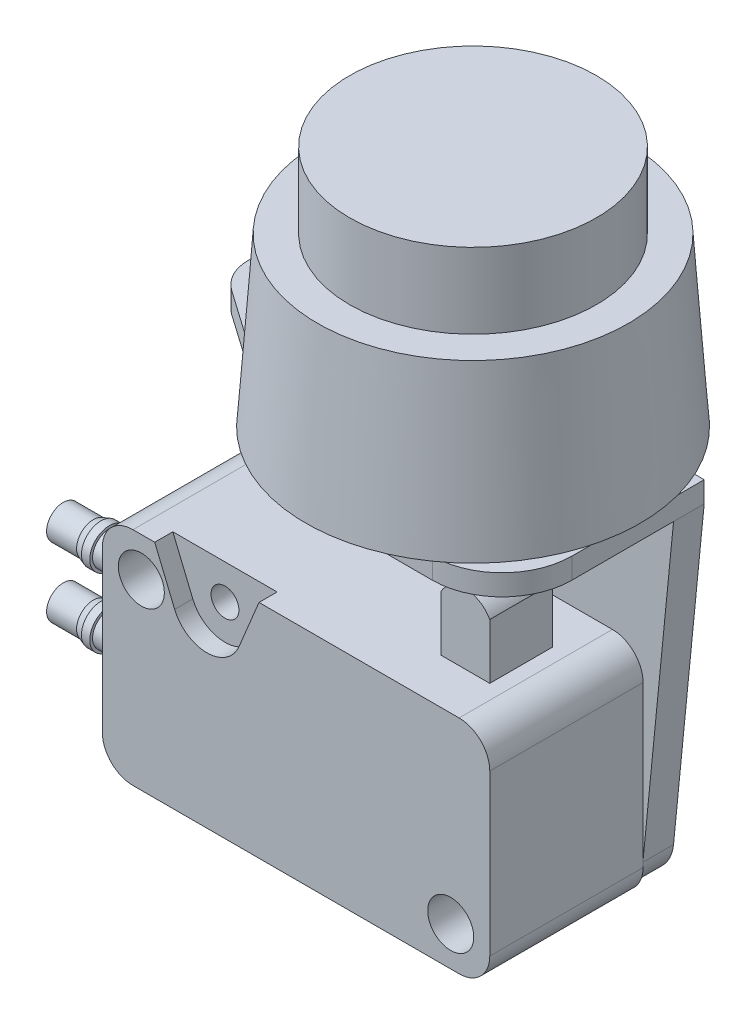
ISO-10303-21;
HEADER;
FILE_DESCRIPTION(('STEP AP214'),'2;1');
FILE_NAME('part.step','',(''),(''),'','','');
FILE_SCHEMA(('AUTOMOTIVE_DESIGN { 1 0 10303 214 1 1 1 1 }'));
ENDSEC;
DATA;
#1=APPLICATION_CONTEXT('core data for automotive mechanical design processes');
#2=APPLICATION_PROTOCOL_DEFINITION('international standard','automotive_design',2000,#1);
#3=PRODUCT_CONTEXT('',#1,'mechanical');
#4=PRODUCT('Part','Part','',(#3));
#5=PRODUCT_RELATED_PRODUCT_CATEGORY('part','',(#4));
#6=PRODUCT_DEFINITION_FORMATION('','',#4);
#7=PRODUCT_DEFINITION_CONTEXT('part definition',#1,'design');
#8=PRODUCT_DEFINITION('design','',#6,#7);
#9=PRODUCT_DEFINITION_SHAPE('','',#8);
#10=(LENGTH_UNIT() NAMED_UNIT(*) SI_UNIT(.MILLI.,.METRE.));
#11=(NAMED_UNIT(*) PLANE_ANGLE_UNIT() SI_UNIT($,.RADIAN.));
#12=(NAMED_UNIT(*) SI_UNIT($,.STERADIAN.) SOLID_ANGLE_UNIT());
#13=UNCERTAINTY_MEASURE_WITH_UNIT(LENGTH_MEASURE(1.E-05),#10,'distance_accuracy_value','');
#14=(GEOMETRIC_REPRESENTATION_CONTEXT(3) GLOBAL_UNCERTAINTY_ASSIGNED_CONTEXT((#13)) GLOBAL_UNIT_ASSIGNED_CONTEXT((#10,
#11,#12)) REPRESENTATION_CONTEXT('',''));
#15=CARTESIAN_POINT('',(0.,0.,0.));
#16=DIRECTION('',(0.,0.,1.));
#17=DIRECTION('',(1.,0.,0.));
#18=AXIS2_PLACEMENT_3D('',#15,#16,#17);
#19=CARTESIAN_POINT('',(8.9,10.95,2.25));
#20=DIRECTION('',(0.,0.,-1.));
#21=DIRECTION('',(-1.,0.,0.));
#22=AXIS2_PLACEMENT_3D('',#19,#20,#21);
#23=CYLINDRICAL_SURFACE('',#22,2.);
#24=DIRECTION('',(0.,0.,1.));
#25=VECTOR('',#24,1.);
#26=CARTESIAN_POINT('',(7.15,11.918245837,0.));
#27=LINE('',#26,#25);
#28=CARTESIAN_POINT('',(7.15,11.9182458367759,-2.25));
#29=VERTEX_POINT('',#28);
#30=CARTESIAN_POINT('',(7.15,11.9182458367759,2.25));
#31=VERTEX_POINT('',#30);
#32=EDGE_CURVE('P0_E182',#29,#31,#27,.T.);
#33=ORIENTED_EDGE('',*,*,#32,.T.);
#34=CARTESIAN_POINT('',(8.9,10.95,2.25));
#35=DIRECTION('',(0.,0.,-1.));
#36=DIRECTION('',(-1.,0.,0.));
#37=AXIS2_PLACEMENT_3D('',#34,#35,#36);
#38=CIRCLE('',#37,2.);
#39=CARTESIAN_POINT('',(10.65,11.9182458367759,2.25));
#40=VERTEX_POINT('',#39);
#41=EDGE_CURVE('P0_E208',#31,#40,#38,.T.);
#42=ORIENTED_EDGE('',*,*,#41,.T.);
#43=DIRECTION('',(0.,0.,-1.));
#44=VECTOR('',#43,1.);
#45=CARTESIAN_POINT('',(10.65,11.918245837,0.));
#46=LINE('',#45,#44);
#47=CARTESIAN_POINT('',(10.65,11.9182458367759,-2.25));
#48=VERTEX_POINT('',#47);
#49=EDGE_CURVE('P0_E203',#40,#48,#46,.T.);
#50=ORIENTED_EDGE('',*,*,#49,.T.);
#51=CARTESIAN_POINT('',(8.9,10.95,-2.25));
#52=DIRECTION('',(0.,0.,-1.));
#53=DIRECTION('',(-1.,0.,0.));
#54=AXIS2_PLACEMENT_3D('',#51,#52,#53);
#55=CIRCLE('',#54,2.);
#56=EDGE_CURVE('P0_E178',#29,#48,#55,.T.);
#57=ORIENTED_EDGE('',*,*,#56,.F.);
#58=EDGE_LOOP('',(#33,#42,#50,#57));
#59=FACE_BOUND('',#58,.T.);
#60=ADVANCED_FACE('P0_F24',(#59),#23,.T.);
#61=CARTESIAN_POINT('',(-13.9,-5.75,-5.5));
#62=DIRECTION('',(1.,0.,0.));
#63=DIRECTION('',(0.,1.,0.));
#64=AXIS2_PLACEMENT_3D('',#61,#62,#63);
#65=PLANE('',#64);
#66=DIRECTION('',(0.,0.,-1.));
#67=VECTOR('',#66,1.);
#68=CARTESIAN_POINT('',(-13.9,-5.75000000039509,0.));
#69=LINE('',#68,#67);
#70=CARTESIAN_POINT('',(-13.9,-5.75000000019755,-5.5));
#71=VERTEX_POINT('',#70);
#72=CARTESIAN_POINT('',(-13.9,-5.75000000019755,5.5));
#73=VERTEX_POINT('',#72);
#74=EDGE_CURVE('P0_E330',#71,#73,#69,.F.);
#75=ORIENTED_EDGE('',*,*,#74,.T.);
#76=DIRECTION('',(0.,-1.,0.));
#77=VECTOR('',#76,1.);
#78=CARTESIAN_POINT('',(-13.9,0.,5.5));
#79=LINE('',#78,#77);
#80=CARTESIAN_POINT('',(-13.9,5.75,5.5));
#81=VERTEX_POINT('',#80);
#82=EDGE_CURVE('P0_E250',#81,#73,#79,.T.);
#83=ORIENTED_EDGE('',*,*,#82,.F.);
#84=DIRECTION('',(0.,0.,1.));
#85=VECTOR('',#84,1.);
#86=CARTESIAN_POINT('',(-13.9,5.75,0.));
#87=LINE('',#86,#85);
#88=CARTESIAN_POINT('',(-13.9,5.75,-5.5));
#89=VERTEX_POINT('',#88);
#90=EDGE_CURVE('P0_E284',#81,#89,#87,.F.);
#91=ORIENTED_EDGE('',*,*,#90,.T.);
#92=DIRECTION('',(0.,-1.,0.));
#93=VECTOR('',#92,1.);
#94=CARTESIAN_POINT('',(-13.9,0.,-5.5));
#95=LINE('',#94,#93);
#96=EDGE_CURVE('P0_E273',#89,#71,#95,.T.);
#97=ORIENTED_EDGE('',*,*,#96,.T.);
#98=EDGE_LOOP('',(#75,#83,#91,#97));
#99=FACE_BOUND('',#98,.T.);
#100=ADVANCED_FACE('P0_F481',(#99),#65,.F.);
#101=CARTESIAN_POINT('',(-11.7,-5.75,5.5));
#102=DIRECTION('',(0.,0.,-1.));
#103=DIRECTION('',(-1.,0.,0.));
#104=AXIS2_PLACEMENT_3D('',#101,#102,#103);
#105=CYLINDRICAL_SURFACE('',#104,2.2);
#106=DIRECTION('',(0.,0.,1.));
#107=VECTOR('',#106,1.);
#108=CARTESIAN_POINT('',(-11.7,-7.95,0.));
#109=LINE('',#108,#107);
#110=CARTESIAN_POINT('',(-11.7,-7.95,-5.5));
#111=VERTEX_POINT('',#110);
#112=CARTESIAN_POINT('',(-11.7,-7.95,5.5));
#113=VERTEX_POINT('',#112);
#114=EDGE_CURVE('P0_E328',#111,#113,#109,.T.);
#115=ORIENTED_EDGE('',*,*,#114,.T.);
#116=CARTESIAN_POINT('',(-11.7,-5.75,5.5));
#117=DIRECTION('',(0.,0.,-1.));
#118=DIRECTION('',(-1.,0.,0.));
#119=AXIS2_PLACEMENT_3D('',#116,#117,#118);
#120=CIRCLE('',#119,2.2);
#121=EDGE_CURVE('P0_E248',#73,#113,#120,.F.);
#122=ORIENTED_EDGE('',*,*,#121,.F.);
#123=ORIENTED_EDGE('',*,*,#74,.F.);
#124=CARTESIAN_POINT('',(-11.7,-5.75,-5.5));
#125=DIRECTION('',(0.,0.,-1.));
#126=DIRECTION('',(-1.,0.,0.));
#127=AXIS2_PLACEMENT_3D('',#124,#125,#126);
#128=CIRCLE('',#127,2.2);
#129=EDGE_CURVE('P0_E271',#71,#111,#128,.F.);
#130=ORIENTED_EDGE('',*,*,#129,.T.);
#131=EDGE_LOOP('',(#115,#122,#123,#130));
#132=FACE_BOUND('',#131,.T.);
#133=ADVANCED_FACE('P0_F478',(#132),#105,.T.);
#134=CARTESIAN_POINT('',(-11.7,-7.95,-5.5));
#135=DIRECTION('',(0.,1.,0.));
#136=DIRECTION('',(0.,0.,1.));
#137=AXIS2_PLACEMENT_3D('',#134,#135,#136);
#138=PLANE('',#137);
#139=DIRECTION('',(0.,0.,-1.));
#140=VECTOR('',#139,1.);
#141=CARTESIAN_POINT('',(11.7000000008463,-7.95,0.));
#142=LINE('',#141,#140);
#143=CARTESIAN_POINT('',(11.7000000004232,-7.95,-5.5));
#144=VERTEX_POINT('',#143);
#145=CARTESIAN_POINT('',(11.7000000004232,-7.95,5.5));
#146=VERTEX_POINT('',#145);
#147=EDGE_CURVE('P0_E325',#144,#146,#142,.F.);
#148=ORIENTED_EDGE('',*,*,#147,.T.);
#149=DIRECTION('',(1.,0.,0.));
#150=VECTOR('',#149,1.);
#151=CARTESIAN_POINT('',(0.,-7.95,5.5));
#152=LINE('',#151,#150);
#153=EDGE_CURVE('P0_E247',#113,#146,#152,.T.);
#154=ORIENTED_EDGE('',*,*,#153,.F.);
#155=ORIENTED_EDGE('',*,*,#114,.F.);
#156=DIRECTION('',(1.,0.,0.));
#157=VECTOR('',#156,1.);
#158=CARTESIAN_POINT('',(0.,-7.95,-5.5));
#159=LINE('',#158,#157);
#160=EDGE_CURVE('P0_E270',#111,#144,#159,.T.);
#161=ORIENTED_EDGE('',*,*,#160,.T.);
#162=EDGE_LOOP('',(#148,#154,#155,#161));
#163=FACE_BOUND('',#162,.T.);
#164=ADVANCED_FACE('P0_F370',(#163),#138,.F.);
#165=CARTESIAN_POINT('',(11.7,-5.75,5.5));
#166=DIRECTION('',(0.,0.,-1.));
#167=DIRECTION('',(-1.,0.,0.));
#168=AXIS2_PLACEMENT_3D('',#165,#166,#167);
#169=CYLINDRICAL_SURFACE('',#168,2.2);
#170=DIRECTION('',(0.,0.,1.));
#171=VECTOR('',#170,1.);
#172=CARTESIAN_POINT('',(13.9,-5.75,0.));
#173=LINE('',#172,#171);
#174=CARTESIAN_POINT('',(13.9,-5.75,-5.5));
#175=VERTEX_POINT('',#174);
#176=CARTESIAN_POINT('',(13.9,-5.75,5.5));
#177=VERTEX_POINT('',#176);
#178=EDGE_CURVE('P0_E322',#175,#177,#173,.T.);
#179=ORIENTED_EDGE('',*,*,#178,.T.);
#180=CARTESIAN_POINT('',(11.7,-5.75,5.5));
#181=DIRECTION('',(0.,0.,-1.));
#182=DIRECTION('',(-1.,0.,0.));
#183=AXIS2_PLACEMENT_3D('',#180,#181,#182);
#184=CIRCLE('',#183,2.2);
#185=EDGE_CURVE('P0_E245',#146,#177,#184,.F.);
#186=ORIENTED_EDGE('',*,*,#185,.F.);
#187=ORIENTED_EDGE('',*,*,#147,.F.);
#188=CARTESIAN_POINT('',(11.7,-5.75,-5.5));
#189=DIRECTION('',(0.,0.,-1.));
#190=DIRECTION('',(-1.,0.,0.));
#191=AXIS2_PLACEMENT_3D('',#188,#189,#190);
#192=CIRCLE('',#191,2.2);
#193=EDGE_CURVE('P0_E268',#144,#175,#192,.F.);
#194=ORIENTED_EDGE('',*,*,#193,.T.);
#195=EDGE_LOOP('',(#179,#186,#187,#194));
#196=FACE_BOUND('',#195,.T.);
#197=ADVANCED_FACE('P0_F366',(#196),#169,.T.);
#198=CARTESIAN_POINT('',(13.9,5.75,-5.5));
#199=DIRECTION('',(-1.,0.,0.));
#200=DIRECTION('',(0.,-1.,0.));
#201=AXIS2_PLACEMENT_3D('',#198,#199,#200);
#202=PLANE('',#201);
#203=DIRECTION('',(0.,0.,-1.));
#204=VECTOR('',#203,1.);
#205=CARTESIAN_POINT('',(13.9,5.74999999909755,0.));
#206=LINE('',#205,#204);
#207=CARTESIAN_POINT('',(13.9,5.74999999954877,-5.5));
#208=VERTEX_POINT('',#207);
#209=CARTESIAN_POINT('',(13.9,5.74999999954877,5.5));
#210=VERTEX_POINT('',#209);
#211=EDGE_CURVE('P0_E319',#208,#210,#206,.F.);
#212=ORIENTED_EDGE('',*,*,#211,.T.);
#213=DIRECTION('',(0.,1.,0.));
#214=VECTOR('',#213,1.);
#215=CARTESIAN_POINT('',(13.9,0.,5.5));
#216=LINE('',#215,#214);
#217=EDGE_CURVE('P0_E244',#177,#210,#216,.T.);
#218=ORIENTED_EDGE('',*,*,#217,.F.);
#219=ORIENTED_EDGE('',*,*,#178,.F.);
#220=DIRECTION('',(0.,1.,0.));
#221=VECTOR('',#220,1.);
#222=CARTESIAN_POINT('',(13.9,0.,-5.5));
#223=LINE('',#222,#221);
#224=EDGE_CURVE('P0_E267',#175,#208,#223,.T.);
#225=ORIENTED_EDGE('',*,*,#224,.T.);
#226=EDGE_LOOP('',(#212,#218,#219,#225));
#227=FACE_BOUND('',#226,.T.);
#228=ADVANCED_FACE('P0_F358',(#227),#202,.F.);
#229=CARTESIAN_POINT('',(11.1,-5.15,-5.5));
#230=DIRECTION('',(0.,0.,1.));
#231=DIRECTION('',(1.,0.,0.));
#232=AXIS2_PLACEMENT_3D('',#229,#230,#231);
#233=CYLINDRICAL_SURFACE('',#232,1.65);
#234=CARTESIAN_POINT('',(11.1,-5.15,5.5));
#235=DIRECTION('',(0.,0.,1.));
#236=DIRECTION('',(1.,0.,0.));
#237=AXIS2_PLACEMENT_3D('',#234,#235,#236);
#238=CIRCLE('',#237,1.65);
#239=CARTESIAN_POINT('',(12.75,-5.15,5.5));
#240=VERTEX_POINT('',#239);
#241=EDGE_CURVE('P0_E239',#240,#240,#238,.F.);
#242=ORIENTED_EDGE('',*,*,#241,.F.);
#243=EDGE_LOOP('',(#242));
#244=FACE_BOUND('',#243,.T.);
#245=CARTESIAN_POINT('',(11.1,-5.15,-5.5));
#246=DIRECTION('',(0.,0.,1.));
#247=DIRECTION('',(1.,0.,0.));
#248=AXIS2_PLACEMENT_3D('',#245,#246,#247);
#249=CIRCLE('',#248,1.65);
#250=CARTESIAN_POINT('',(12.75,-5.15,-5.5));
#251=VERTEX_POINT('',#250);
#252=EDGE_CURVE('P0_E261',#251,#251,#249,.F.);
#253=ORIENTED_EDGE('',*,*,#252,.T.);
#254=EDGE_LOOP('',(#253));
#255=FACE_BOUND('',#254,.T.);
#256=ADVANCED_FACE('P0_F471',(#244,#255),#233,.F.);
#257=CARTESIAN_POINT('',(-11.1,5.15,-5.5));
#258=DIRECTION('',(0.,0.,1.));
#259=DIRECTION('',(1.,0.,0.));
#260=AXIS2_PLACEMENT_3D('',#257,#258,#259);
#261=CYLINDRICAL_SURFACE('',#260,1.65);
#262=CARTESIAN_POINT('',(-11.1,5.15,5.5));
#263=DIRECTION('',(0.,0.,1.));
#264=DIRECTION('',(1.,0.,0.));
#265=AXIS2_PLACEMENT_3D('',#262,#263,#264);
#266=CIRCLE('',#265,1.65);
#267=CARTESIAN_POINT('',(-9.45,5.15,5.5));
#268=VERTEX_POINT('',#267);
#269=EDGE_CURVE('P0_E236',#268,#268,#266,.F.);
#270=ORIENTED_EDGE('',*,*,#269,.F.);
#271=EDGE_LOOP('',(#270));
#272=FACE_BOUND('',#271,.T.);
#273=CARTESIAN_POINT('',(-11.1,5.15,-5.5));
#274=DIRECTION('',(0.,0.,1.));
#275=DIRECTION('',(1.,0.,0.));
#276=AXIS2_PLACEMENT_3D('',#273,#274,#275);
#277=CIRCLE('',#276,1.65);
#278=CARTESIAN_POINT('',(-9.45,5.15,-5.5));
#279=VERTEX_POINT('',#278);
#280=EDGE_CURVE('P0_E258',#279,#279,#277,.F.);
#281=ORIENTED_EDGE('',*,*,#280,.T.);
#282=EDGE_LOOP('',(#281));
#283=FACE_BOUND('',#282,.T.);
#284=ADVANCED_FACE('P0_F468',(#272,#283),#261,.F.);
#285=CARTESIAN_POINT('',(11.7,5.75,5.5));
#286=DIRECTION('',(0.,0.,-1.));
#287=DIRECTION('',(-1.,0.,0.));
#288=AXIS2_PLACEMENT_3D('',#285,#286,#287);
#289=CYLINDRICAL_SURFACE('',#288,2.2);
#290=DIRECTION('',(0.,0.,1.));
#291=VECTOR('',#290,1.);
#292=CARTESIAN_POINT('',(11.7,7.95,0.));
#293=LINE('',#292,#291);
#294=CARTESIAN_POINT('',(11.7,7.95,-5.5));
#295=VERTEX_POINT('',#294);
#296=CARTESIAN_POINT('',(11.7,7.95,5.5));
#297=VERTEX_POINT('',#296);
#298=EDGE_CURVE('P0_E287',#295,#297,#293,.T.);
#299=ORIENTED_EDGE('',*,*,#298,.T.);
#300=CARTESIAN_POINT('',(11.7,5.75,5.5));
#301=DIRECTION('',(0.,0.,-1.));
#302=DIRECTION('',(-1.,0.,0.));
#303=AXIS2_PLACEMENT_3D('',#300,#301,#302);
#304=CIRCLE('',#303,2.2);
#305=EDGE_CURVE('P0_E242',#210,#297,#304,.F.);
#306=ORIENTED_EDGE('',*,*,#305,.F.);
#307=ORIENTED_EDGE('',*,*,#211,.F.);
#308=CARTESIAN_POINT('',(11.7,5.75,-5.5));
#309=DIRECTION('',(0.,0.,-1.));
#310=DIRECTION('',(-1.,0.,0.));
#311=AXIS2_PLACEMENT_3D('',#308,#309,#310);
#312=CIRCLE('',#311,2.2);
#313=EDGE_CURVE('P0_E264',#208,#295,#312,.F.);
#314=ORIENTED_EDGE('',*,*,#313,.T.);
#315=EDGE_LOOP('',(#299,#306,#307,#314));
#316=FACE_BOUND('',#315,.T.);
#317=ADVANCED_FACE('P0_F428',(#316),#289,.T.);
#318=CARTESIAN_POINT('',(-11.7,5.75,5.5));
#319=DIRECTION('',(0.,0.,-1.));
#320=DIRECTION('',(-1.,0.,0.));
#321=AXIS2_PLACEMENT_3D('',#318,#319,#320);
#322=CYLINDRICAL_SURFACE('',#321,2.2);
#323=ORIENTED_EDGE('',*,*,#90,.F.);
#324=CARTESIAN_POINT('',(-11.7,5.75,5.5));
#325=DIRECTION('',(0.,0.,-1.));
#326=DIRECTION('',(-1.,0.,0.));
#327=AXIS2_PLACEMENT_3D('',#324,#325,#326);
#328=CIRCLE('',#327,2.2);
#329=CARTESIAN_POINT('',(-11.7,7.95,5.5));
#330=VERTEX_POINT('',#329);
#331=EDGE_CURVE('P0_E251',#330,#81,#328,.F.);
#332=ORIENTED_EDGE('',*,*,#331,.F.);
#333=DIRECTION('',(0.,0.,-1.));
#334=VECTOR('',#333,1.);
#335=CARTESIAN_POINT('',(-11.7,7.95,0.));
#336=LINE('',#335,#334);
#337=CARTESIAN_POINT('',(-11.7,7.95,-5.5));
#338=VERTEX_POINT('',#337);
#339=EDGE_CURVE('P0_E304',#330,#338,#336,.T.);
#340=ORIENTED_EDGE('',*,*,#339,.T.);
#341=CARTESIAN_POINT('',(-11.7,5.75,-5.5));
#342=DIRECTION('',(0.,0.,-1.));
#343=DIRECTION('',(-1.,0.,0.));
#344=AXIS2_PLACEMENT_3D('',#341,#342,#343);
#345=CIRCLE('',#344,2.2);
#346=EDGE_CURVE('P0_E28',#338,#89,#345,.F.);
#347=ORIENTED_EDGE('',*,*,#346,.T.);
#348=EDGE_LOOP('',(#323,#332,#340,#347));
#349=FACE_BOUND('',#348,.T.);
#350=ADVANCED_FACE('P0_F372',(#349),#322,.T.);
#351=CARTESIAN_POINT('',(-13.9,-7.95,-5.5));
#352=DIRECTION('',(0.,0.,1.));
#353=DIRECTION('',(1.,0.,0.));
#354=AXIS2_PLACEMENT_3D('',#351,#352,#353);
#355=PLANE('',#354);
#356=ORIENTED_EDGE('',*,*,#280,.F.);
#357=EDGE_LOOP('',(#356));
#358=FACE_BOUND('',#357,.T.);
#359=ORIENTED_EDGE('',*,*,#252,.F.);
#360=EDGE_LOOP('',(#359));
#361=FACE_BOUND('',#360,.T.);
#362=DIRECTION('',(0.382683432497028,0.923879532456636,0.));
#363=VECTOR('',#362,1.);
#364=CARTESIAN_POINT('',(-3.374393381,6.2216457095,-5.5));
#365=LINE('',#364,#363);
#366=CARTESIAN_POINT('',(-4.09030116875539,4.49329141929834,-5.5));
#367=VERTEX_POINT('',#366);
#368=CARTESIAN_POINT('',(-2.65848558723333,7.95,-5.5));
#369=VERTEX_POINT('',#368);
#370=EDGE_CURVE('P0_E235',#367,#369,#365,.T.);
#371=ORIENTED_EDGE('',*,*,#370,.T.);
#372=DIRECTION('',(1.,0.,0.));
#373=VECTOR('',#372,1.);
#374=CARTESIAN_POINT('',(0.,7.95,-5.5));
#375=LINE('',#374,#373);
#376=EDGE_CURVE('P0_E196',#369,#295,#375,.T.);
#377=ORIENTED_EDGE('',*,*,#376,.T.);
#378=ORIENTED_EDGE('',*,*,#313,.F.);
#379=ORIENTED_EDGE('',*,*,#224,.F.);
#380=ORIENTED_EDGE('',*,*,#193,.F.);
#381=ORIENTED_EDGE('',*,*,#160,.F.);
#382=ORIENTED_EDGE('',*,*,#129,.F.);
#383=ORIENTED_EDGE('',*,*,#96,.F.);
#384=ORIENTED_EDGE('',*,*,#346,.F.);
#385=DIRECTION('',(1.,0.,0.));
#386=VECTOR('',#385,1.);
#387=CARTESIAN_POINT('',(0.,7.95,-5.5));
#388=LINE('',#387,#386);
#389=CARTESIAN_POINT('',(-10.1415144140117,7.95000000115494,-5.5));
#390=VERTEX_POINT('',#389);
#391=EDGE_CURVE('P0_E301',#338,#390,#388,.T.);
#392=ORIENTED_EDGE('',*,*,#391,.T.);
#393=DIRECTION('',(0.382683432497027,-0.923879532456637,0.));
#394=VECTOR('',#393,1.);
#395=CARTESIAN_POINT('',(-9.425606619,6.2216457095,-5.5));
#396=LINE('',#395,#394);
#397=CARTESIAN_POINT('',(-8.70969883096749,4.49329141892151,-5.5));
#398=VERTEX_POINT('',#397);
#399=EDGE_CURVE('P0_E150',#390,#398,#396,.T.);
#400=ORIENTED_EDGE('',*,*,#399,.T.);
#401=CARTESIAN_POINT('',(-6.4,5.45,-5.5));
#402=DIRECTION('',(0.,0.,-1.));
#403=DIRECTION('',(-1.,0.,0.));
#404=AXIS2_PLACEMENT_3D('',#401,#402,#403);
#405=CIRCLE('',#404,2.5);
#406=EDGE_CURVE('P0_E232',#367,#398,#405,.T.);
#407=ORIENTED_EDGE('',*,*,#406,.F.);
#408=EDGE_LOOP('',(#371,#377,#378,#379,#380,#381,#382,#383,#384,#392,#400,#407));
#409=FACE_BOUND('',#408,.T.);
#410=ADVANCED_FACE('P0_F363',(#358,#361,#409),#355,.F.);
#411=CARTESIAN_POINT('',(10.65,11.918245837,-2.25));
#412=DIRECTION('',(-1.,0.,0.));
#413=DIRECTION('',(0.,-1.,0.));
#414=AXIS2_PLACEMENT_3D('',#411,#412,#413);
#415=PLANE('',#414);
#416=ORIENTED_EDGE('',*,*,#49,.F.);
#417=DIRECTION('',(0.,-1.,0.));
#418=VECTOR('',#417,1.);
#419=CARTESIAN_POINT('',(10.65,10.465,2.25));
#420=LINE('',#419,#418);
#421=CARTESIAN_POINT('',(10.649999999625,7.95,2.2500000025));
#422=VERTEX_POINT('',#421);
#423=EDGE_CURVE('P0_E194',#40,#422,#420,.T.);
#424=ORIENTED_EDGE('',*,*,#423,.T.);
#425=DIRECTION('',(0.,0.,-1.));
#426=VECTOR('',#425,1.);
#427=CARTESIAN_POINT('',(10.649999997,7.95,0.));
#428=LINE('',#427,#426);
#429=CARTESIAN_POINT('',(10.64999999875,7.95,-2.25000000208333));
#430=VERTEX_POINT('',#429);
#431=EDGE_CURVE('P0_E188',#422,#430,#428,.T.);
#432=ORIENTED_EDGE('',*,*,#431,.T.);
#433=DIRECTION('',(0.,-1.,0.));
#434=VECTOR('',#433,1.);
#435=CARTESIAN_POINT('',(10.65,10.465,-2.25));
#436=LINE('',#435,#434);
#437=EDGE_CURVE('P0_E173',#48,#430,#436,.T.);
#438=ORIENTED_EDGE('',*,*,#437,.F.);
#439=EDGE_LOOP('',(#416,#424,#432,#438));
#440=FACE_BOUND('',#439,.T.);
#441=ADVANCED_FACE('P0_F192',(#440),#415,.F.);
#442=CARTESIAN_POINT('',(10.65,7.95,-2.25));
#443=DIRECTION('',(0.,0.,-1.));
#444=DIRECTION('',(-1.,0.,0.));
#445=AXIS2_PLACEMENT_3D('',#442,#443,#444);
#446=PLANE('',#445);
#447=ORIENTED_EDGE('',*,*,#437,.T.);
#448=DIRECTION('',(-1.,0.,0.));
#449=VECTOR('',#448,1.);
#450=CARTESIAN_POINT('',(0.,7.95,-2.250000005));
#451=LINE('',#450,#449);
#452=CARTESIAN_POINT('',(7.1500000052,7.95,-2.250000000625));
#453=VERTEX_POINT('',#452);
#454=EDGE_CURVE('P0_E176',#430,#453,#451,.T.);
#455=ORIENTED_EDGE('',*,*,#454,.T.);
#456=DIRECTION('',(0.,1.,0.));
#457=VECTOR('',#456,1.);
#458=CARTESIAN_POINT('',(7.15,9.9341229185,-2.25));
#459=LINE('',#458,#457);
#460=EDGE_CURVE('P0_E167',#453,#29,#459,.T.);
#461=ORIENTED_EDGE('',*,*,#460,.T.);
#462=ORIENTED_EDGE('',*,*,#56,.T.);
#463=EDGE_LOOP('',(#447,#455,#461,#462));
#464=FACE_BOUND('',#463,.T.);
#465=ADVANCED_FACE('P0_F175',(#464),#446,.T.);
#466=CARTESIAN_POINT('',(7.15,7.95,-2.25));
#467=DIRECTION('',(1.,0.,0.));
#468=DIRECTION('',(0.,1.,0.));
#469=AXIS2_PLACEMENT_3D('',#466,#467,#468);
#470=PLANE('',#469);
#471=DIRECTION('',(0.,0.,1.));
#472=VECTOR('',#471,1.);
#473=CARTESIAN_POINT('',(7.1500000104,7.95,0.));
#474=LINE('',#473,#472);
#475=CARTESIAN_POINT('',(7.15,7.95,2.25));
#476=VERTEX_POINT('',#475);
#477=EDGE_CURVE('P0_E190',#453,#476,#474,.T.);
#478=ORIENTED_EDGE('',*,*,#477,.T.);
#479=DIRECTION('',(0.,1.,0.));
#480=VECTOR('',#479,1.);
#481=CARTESIAN_POINT('',(7.15,10.465,2.25));
#482=LINE('',#481,#480);
#483=EDGE_CURVE('P0_E254',#476,#31,#482,.T.);
#484=ORIENTED_EDGE('',*,*,#483,.T.);
#485=ORIENTED_EDGE('',*,*,#32,.F.);
#486=ORIENTED_EDGE('',*,*,#460,.F.);
#487=EDGE_LOOP('',(#478,#484,#485,#486));
#488=FACE_BOUND('',#487,.T.);
#489=ADVANCED_FACE('P0_F342',(#488),#470,.F.);
#490=CARTESIAN_POINT('',(10.65,7.95,2.25));
#491=DIRECTION('',(0.,0.,-1.));
#492=DIRECTION('',(-1.,0.,0.));
#493=AXIS2_PLACEMENT_3D('',#490,#491,#492);
#494=PLANE('',#493);
#495=DIRECTION('',(1.,0.,0.));
#496=VECTOR('',#495,1.);
#497=CARTESIAN_POINT('',(0.,7.95,2.250000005));
#498=LINE('',#497,#496);
#499=EDGE_CURVE('P0_E335',#476,#422,#498,.T.);
#500=ORIENTED_EDGE('',*,*,#499,.T.);
#501=ORIENTED_EDGE('',*,*,#423,.F.);
#502=ORIENTED_EDGE('',*,*,#41,.F.);
#503=ORIENTED_EDGE('',*,*,#483,.F.);
#504=EDGE_LOOP('',(#500,#501,#502,#503));
#505=FACE_BOUND('',#504,.T.);
#506=ADVANCED_FACE('P0_F500',(#505),#494,.F.);
#507=CARTESIAN_POINT('',(-13.9,-7.95,5.5));
#508=DIRECTION('',(0.,0.,1.));
#509=DIRECTION('',(1.,0.,0.));
#510=AXIS2_PLACEMENT_3D('',#507,#508,#509);
#511=PLANE('',#510);
#512=ORIENTED_EDGE('',*,*,#269,.T.);
#513=EDGE_LOOP('',(#512));
#514=FACE_BOUND('',#513,.T.);
#515=ORIENTED_EDGE('',*,*,#241,.T.);
#516=EDGE_LOOP('',(#515));
#517=FACE_BOUND('',#516,.T.);
#518=DIRECTION('',(-0.382683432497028,-0.923879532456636,0.));
#519=VECTOR('',#518,1.);
#520=CARTESIAN_POINT('',(-3.374393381,6.2216457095,5.5));
#521=LINE('',#520,#519);
#522=CARTESIAN_POINT('',(-2.65848558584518,7.95000000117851,5.5));
#523=VERTEX_POINT('',#522);
#524=CARTESIAN_POINT('',(-4.09030116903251,4.49329141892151,5.5));
#525=VERTEX_POINT('',#524);
#526=EDGE_CURVE('P0_E290',#523,#525,#521,.T.);
#527=ORIENTED_EDGE('',*,*,#526,.T.);
#528=CARTESIAN_POINT('',(-6.4,5.45,5.5));
#529=DIRECTION('',(0.,0.,1.));
#530=DIRECTION('',(1.,0.,0.));
#531=AXIS2_PLACEMENT_3D('',#528,#529,#530);
#532=CIRCLE('',#531,2.5);
#533=CARTESIAN_POINT('',(-8.70969883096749,4.49329141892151,5.5));
#534=VERTEX_POINT('',#533);
#535=EDGE_CURVE('P0_E229',#534,#525,#532,.T.);
#536=ORIENTED_EDGE('',*,*,#535,.F.);
#537=DIRECTION('',(-0.382683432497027,0.923879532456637,0.));
#538=VECTOR('',#537,1.);
#539=CARTESIAN_POINT('',(-9.425606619,6.2216457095,5.5));
#540=LINE('',#539,#538);
#541=CARTESIAN_POINT('',(-10.1415144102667,7.95,5.5));
#542=VERTEX_POINT('',#541);
#543=EDGE_CURVE('P0_E228',#534,#542,#540,.T.);
#544=ORIENTED_EDGE('',*,*,#543,.T.);
#545=DIRECTION('',(-1.,0.,0.));
#546=VECTOR('',#545,1.);
#547=CARTESIAN_POINT('',(0.,7.95,5.5));
#548=LINE('',#547,#546);
#549=EDGE_CURVE('P0_E309',#542,#330,#548,.T.);
#550=ORIENTED_EDGE('',*,*,#549,.T.);
#551=ORIENTED_EDGE('',*,*,#331,.T.);
#552=ORIENTED_EDGE('',*,*,#82,.T.);
#553=ORIENTED_EDGE('',*,*,#121,.T.);
#554=ORIENTED_EDGE('',*,*,#153,.T.);
#555=ORIENTED_EDGE('',*,*,#185,.T.);
#556=ORIENTED_EDGE('',*,*,#217,.T.);
#557=ORIENTED_EDGE('',*,*,#305,.T.);
#558=DIRECTION('',(-1.,0.,0.));
#559=VECTOR('',#558,1.);
#560=CARTESIAN_POINT('',(0.,7.95,5.5));
#561=LINE('',#560,#559);
#562=EDGE_CURVE('P0_E289',#297,#523,#561,.T.);
#563=ORIENTED_EDGE('',*,*,#562,.T.);
#564=EDGE_LOOP('',(#527,#536,#544,#550,#551,#552,#553,#554,#555,#556,#557,#563));
#565=FACE_BOUND('',#564,.T.);
#566=ADVANCED_FACE('P0_F379',(#514,#517,#565),#511,.T.);
#567=CARTESIAN_POINT('',(-4.090301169,4.493291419,-5.5));
#568=DIRECTION('',(0.923879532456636,-0.382683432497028,0.));
#569=DIRECTION('',(0.382683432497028,0.923879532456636,0.));
#570=AXIS2_PLACEMENT_3D('',#567,#568,#569);
#571=PLANE('',#570);
#572=DIRECTION('',(0.,0.,1.));
#573=VECTOR('',#572,1.);
#574=CARTESIAN_POINT('',(-4.09030116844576,4.49329141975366,-4.85));
#575=LINE('',#574,#573);
#576=CARTESIAN_POINT('',(-4.09030116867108,4.49329141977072,-4.2));
#577=VERTEX_POINT('',#576);
#578=EDGE_CURVE('P0_E234',#577,#367,#575,.F.);
#579=ORIENTED_EDGE('',*,*,#578,.F.);
#580=DIRECTION('',(-0.382683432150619,-0.923879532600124,0.));
#581=VECTOR('',#580,1.);
#582=CARTESIAN_POINT('',(-2.65848559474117,7.95,-4.2));
#583=LINE('',#582,#581);
#584=CARTESIAN_POINT('',(-2.65848558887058,7.95,-4.2));
#585=VERTEX_POINT('',#584);
#586=EDGE_CURVE('P0_E226',#585,#577,#583,.T.);
#587=ORIENTED_EDGE('',*,*,#586,.F.);
#588=DIRECTION('',(0.,0.,-1.));
#589=VECTOR('',#588,1.);
#590=CARTESIAN_POINT('',(-2.658485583,7.95,0.));
#591=LINE('',#590,#589);
#592=EDGE_CURVE('P0_E199',#585,#369,#591,.T.);
#593=ORIENTED_EDGE('',*,*,#592,.T.);
#594=ORIENTED_EDGE('',*,*,#370,.F.);
#595=EDGE_LOOP('',(#579,#587,#593,#594));
#596=FACE_BOUND('',#595,.T.);
#597=ADVANCED_FACE('P0_F434',(#596),#571,.F.);
#598=CARTESIAN_POINT('',(-6.4,5.45,-4.2));
#599=DIRECTION('',(0.,0.,-1.));
#600=DIRECTION('',(-1.,0.,0.));
#601=AXIS2_PLACEMENT_3D('',#598,#599,#600);
#602=CYLINDRICAL_SURFACE('',#601,2.5);
#603=CARTESIAN_POINT('',(-6.4,5.45,-4.2));
#604=DIRECTION('',(0.,0.,-1.));
#605=DIRECTION('',(-1.,0.,0.));
#606=AXIS2_PLACEMENT_3D('',#603,#604,#605);
#607=CIRCLE('',#606,2.5);
#608=CARTESIAN_POINT('',(-8.70969883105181,4.49329141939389,-4.2));
#609=VERTEX_POINT('',#608);
#610=EDGE_CURVE('P0_E224',#577,#609,#607,.T.);
#611=ORIENTED_EDGE('',*,*,#610,.F.);
#612=ORIENTED_EDGE('',*,*,#578,.T.);
#613=ORIENTED_EDGE('',*,*,#406,.T.);
#614=DIRECTION('',(0.,0.,1.));
#615=VECTOR('',#614,1.);
#616=CARTESIAN_POINT('',(-8.709698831,4.493291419,-4.85));
#617=LINE('',#616,#615);
#618=EDGE_CURVE('P0_E298',#398,#609,#617,.T.);
#619=ORIENTED_EDGE('',*,*,#618,.T.);
#620=EDGE_LOOP('',(#611,#612,#613,#619));
#621=FACE_BOUND('',#620,.T.);
#622=ADVANCED_FACE('P0_F441',(#621),#602,.F.);
#623=CARTESIAN_POINT('',(-10.141514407,7.95,-5.5));
#624=DIRECTION('',(-0.923879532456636,-0.382683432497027,0.));
#625=DIRECTION('',(0.382683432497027,-0.923879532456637,0.));
#626=AXIS2_PLACEMENT_3D('',#623,#624,#625);
#627=PLANE('',#626);
#628=DIRECTION('',(0.,0.,1.));
#629=VECTOR('',#628,1.);
#630=CARTESIAN_POINT('',(-10.1415144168,7.95,0.));
#631=LINE('',#630,#629);
#632=CARTESIAN_POINT('',(-10.1415144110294,7.95,-4.2));
#633=VERTEX_POINT('',#632);
#634=EDGE_CURVE('P0_E303',#390,#633,#631,.T.);
#635=ORIENTED_EDGE('',*,*,#634,.T.);
#636=DIRECTION('',(-0.382683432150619,0.923879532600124,0.));
#637=VECTOR('',#636,1.);
#638=CARTESIAN_POINT('',(-8.70969883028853,4.49329141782,-4.2));
#639=LINE('',#638,#637);
#640=EDGE_CURVE('P0_E222',#609,#633,#639,.T.);
#641=ORIENTED_EDGE('',*,*,#640,.F.);
#642=ORIENTED_EDGE('',*,*,#618,.F.);
#643=ORIENTED_EDGE('',*,*,#399,.F.);
#644=EDGE_LOOP('',(#635,#641,#642,#643));
#645=FACE_BOUND('',#644,.T.);
#646=ADVANCED_FACE('P0_F442',(#645),#627,.F.);
#647=CARTESIAN_POINT('',(-6.4,5.45,4.2));
#648=DIRECTION('',(0.,0.,1.));
#649=DIRECTION('',(1.,0.,0.));
#650=AXIS2_PLACEMENT_3D('',#647,#648,#649);
#651=CYLINDRICAL_SURFACE('',#650,2.5);
#652=CARTESIAN_POINT('',(-6.4,5.45,4.2));
#653=DIRECTION('',(0.,0.,1.));
#654=DIRECTION('',(1.,0.,0.));
#655=AXIS2_PLACEMENT_3D('',#652,#653,#654);
#656=CIRCLE('',#655,2.5);
#657=CARTESIAN_POINT('',(-8.7096988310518,4.49329141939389,4.2));
#658=VERTEX_POINT('',#657);
#659=CARTESIAN_POINT('',(-4.0903011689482,4.49329141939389,4.2));
#660=VERTEX_POINT('',#659);
#661=EDGE_CURVE('P0_E219',#658,#660,#656,.T.);
#662=ORIENTED_EDGE('',*,*,#661,.F.);
#663=DIRECTION('',(0.,0.,1.));
#664=VECTOR('',#663,1.);
#665=CARTESIAN_POINT('',(-8.709698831,4.493291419,4.85));
#666=LINE('',#665,#664);
#667=EDGE_CURVE('P0_E388',#658,#534,#666,.T.);
#668=ORIENTED_EDGE('',*,*,#667,.T.);
#669=ORIENTED_EDGE('',*,*,#535,.T.);
#670=DIRECTION('',(0.,0.,-1.));
#671=VECTOR('',#670,1.);
#672=CARTESIAN_POINT('',(-4.090301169,4.493291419,4.85));
#673=LINE('',#672,#671);
#674=EDGE_CURVE('P0_E231',#525,#660,#673,.T.);
#675=ORIENTED_EDGE('',*,*,#674,.T.);
#676=EDGE_LOOP('',(#662,#668,#669,#675));
#677=FACE_BOUND('',#676,.T.);
#678=ADVANCED_FACE('P0_F416',(#677),#651,.F.);
#679=CARTESIAN_POINT('',(-4.090301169,4.493291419,4.2));
#680=DIRECTION('',(0.923879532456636,-0.382683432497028,0.));
#681=DIRECTION('',(0.382683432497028,0.923879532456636,0.));
#682=AXIS2_PLACEMENT_3D('',#679,#680,#681);
#683=PLANE('',#682);
#684=DIRECTION('',(0.,0.,-1.));
#685=VECTOR('',#684,1.);
#686=CARTESIAN_POINT('',(-2.658485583,7.95,0.));
#687=LINE('',#686,#685);
#688=CARTESIAN_POINT('',(-2.65848558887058,7.95,4.2));
#689=VERTEX_POINT('',#688);
#690=EDGE_CURVE('P0_E316',#523,#689,#687,.T.);
#691=ORIENTED_EDGE('',*,*,#690,.T.);
#692=DIRECTION('',(0.382683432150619,0.923879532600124,0.));
#693=VECTOR('',#692,1.);
#694=CARTESIAN_POINT('',(-4.09030116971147,4.49329141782,4.2));
#695=LINE('',#694,#693);
#696=EDGE_CURVE('P0_E217',#660,#689,#695,.T.);
#697=ORIENTED_EDGE('',*,*,#696,.F.);
#698=ORIENTED_EDGE('',*,*,#674,.F.);
#699=ORIENTED_EDGE('',*,*,#526,.F.);
#700=EDGE_LOOP('',(#691,#697,#698,#699));
#701=FACE_BOUND('',#700,.T.);
#702=ADVANCED_FACE('P0_F424',(#701),#683,.F.);
#703=CARTESIAN_POINT('',(-11.7,7.95,5.5));
#704=DIRECTION('',(0.,-1.,0.));
#705=DIRECTION('',(0.,0.,-1.));
#706=AXIS2_PLACEMENT_3D('',#703,#704,#705);
#707=PLANE('',#706);
#708=ORIENTED_EDGE('',*,*,#477,.F.);
#709=ORIENTED_EDGE('',*,*,#454,.F.);
#710=ORIENTED_EDGE('',*,*,#431,.F.);
#711=ORIENTED_EDGE('',*,*,#499,.F.);
#712=EDGE_LOOP('',(#708,#709,#710,#711));
#713=FACE_BOUND('',#712,.T.);
#714=ORIENTED_EDGE('',*,*,#592,.F.);
#715=DIRECTION('',(1.,0.,0.));
#716=VECTOR('',#715,1.);
#717=CARTESIAN_POINT('',(-6.4,7.95,-4.2));
#718=LINE('',#717,#716);
#719=EDGE_CURVE('P0_E221',#633,#585,#718,.T.);
#720=ORIENTED_EDGE('',*,*,#719,.F.);
#721=ORIENTED_EDGE('',*,*,#634,.F.);
#722=ORIENTED_EDGE('',*,*,#391,.F.);
#723=ORIENTED_EDGE('',*,*,#339,.F.);
#724=ORIENTED_EDGE('',*,*,#549,.F.);
#725=DIRECTION('',(0.,0.,-1.));
#726=VECTOR('',#725,1.);
#727=CARTESIAN_POINT('',(-10.141514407,7.95,4.85));
#728=LINE('',#727,#726);
#729=CARTESIAN_POINT('',(-10.1415144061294,7.95,4.2));
#730=VERTEX_POINT('',#729);
#731=EDGE_CURVE('P0_E337',#542,#730,#728,.T.);
#732=ORIENTED_EDGE('',*,*,#731,.T.);
#733=DIRECTION('',(-1.,0.,0.));
#734=VECTOR('',#733,1.);
#735=CARTESIAN_POINT('',(-6.4,7.95,4.2));
#736=LINE('',#735,#734);
#737=EDGE_CURVE('P0_E43',#689,#730,#736,.T.);
#738=ORIENTED_EDGE('',*,*,#737,.F.);
#739=ORIENTED_EDGE('',*,*,#690,.F.);
#740=ORIENTED_EDGE('',*,*,#562,.F.);
#741=ORIENTED_EDGE('',*,*,#298,.F.);
#742=ORIENTED_EDGE('',*,*,#376,.F.);
#743=EDGE_LOOP('',(#714,#720,#721,#722,#723,#724,#732,#738,#739,#740,#741,#742));
#744=FACE_BOUND('',#743,.T.);
#745=ADVANCED_FACE('P0_F185',(#713,#744),#707,.F.);
#746=CARTESIAN_POINT('',(-10.141514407,7.95,4.2));
#747=DIRECTION('',(-0.923879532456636,-0.382683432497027,0.));
#748=DIRECTION('',(0.382683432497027,-0.923879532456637,0.));
#749=AXIS2_PLACEMENT_3D('',#746,#747,#748);
#750=PLANE('',#749);
#751=ORIENTED_EDGE('',*,*,#667,.F.);
#752=DIRECTION('',(0.38268343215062,-0.923879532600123,0.));
#753=VECTOR('',#752,1.);
#754=CARTESIAN_POINT('',(-10.1415144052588,7.95,4.2));
#755=LINE('',#754,#753);
#756=EDGE_CURVE('P0_E215',#730,#658,#755,.T.);
#757=ORIENTED_EDGE('',*,*,#756,.F.);
#758=ORIENTED_EDGE('',*,*,#731,.F.);
#759=ORIENTED_EDGE('',*,*,#543,.F.);
#760=EDGE_LOOP('',(#751,#757,#758,#759));
#761=FACE_BOUND('',#760,.T.);
#762=ADVANCED_FACE('P0_F420',(#761),#750,.F.);
#763=CARTESIAN_POINT('',(-2.61358742,2.92,-4.2));
#764=DIRECTION('',(0.,0.,-1.));
#765=DIRECTION('',(-1.,0.,0.));
#766=AXIS2_PLACEMENT_3D('',#763,#764,#765);
#767=PLANE('',#766);
#768=CARTESIAN_POINT('',(-6.4,5.45,-4.2));
#769=DIRECTION('',(0.,0.,1.));
#770=DIRECTION('',(1.,0.,0.));
#771=AXIS2_PLACEMENT_3D('',#768,#769,#770);
#772=CIRCLE('',#771,1.);
#773=CARTESIAN_POINT('',(-5.4,5.45,-4.2));
#774=VERTEX_POINT('',#773);
#775=EDGE_CURVE('P0_E34',#774,#774,#772,.F.);
#776=ORIENTED_EDGE('',*,*,#775,.F.);
#777=EDGE_LOOP('',(#776));
#778=FACE_BOUND('',#777,.T.);
#779=ORIENTED_EDGE('',*,*,#640,.T.);
#780=ORIENTED_EDGE('',*,*,#719,.T.);
#781=ORIENTED_EDGE('',*,*,#586,.T.);
#782=ORIENTED_EDGE('',*,*,#610,.T.);
#783=EDGE_LOOP('',(#779,#780,#781,#782));
#784=FACE_BOUND('',#783,.T.);
#785=ADVANCED_FACE('P0_F437',(#778,#784),#767,.T.);
#786=CARTESIAN_POINT('',(-10.18641258,2.92,4.2));
#787=DIRECTION('',(0.,0.,1.));
#788=DIRECTION('',(1.,0.,0.));
#789=AXIS2_PLACEMENT_3D('',#786,#787,#788);
#790=PLANE('',#789);
#791=CARTESIAN_POINT('',(-6.4,5.45,4.2));
#792=DIRECTION('',(0.,0.,1.));
#793=DIRECTION('',(1.,0.,0.));
#794=AXIS2_PLACEMENT_3D('',#791,#792,#793);
#795=CIRCLE('',#794,1.);
#796=CARTESIAN_POINT('',(-5.4,5.45,4.2));
#797=VERTEX_POINT('',#796);
#798=EDGE_CURVE('P0_E13',#797,#797,#795,.T.);
#799=ORIENTED_EDGE('',*,*,#798,.F.);
#800=EDGE_LOOP('',(#799));
#801=FACE_BOUND('',#800,.T.);
#802=ORIENTED_EDGE('',*,*,#737,.T.);
#803=ORIENTED_EDGE('',*,*,#756,.T.);
#804=ORIENTED_EDGE('',*,*,#661,.T.);
#805=ORIENTED_EDGE('',*,*,#696,.T.);
#806=EDGE_LOOP('',(#802,#803,#804,#805));
#807=FACE_BOUND('',#806,.T.);
#808=ADVANCED_FACE('P0_F26',(#801,#807),#790,.T.);
#809=CARTESIAN_POINT('',(-6.4,5.45,-4.2));
#810=DIRECTION('',(0.,0.,1.));
#811=DIRECTION('',(1.,0.,0.));
#812=AXIS2_PLACEMENT_3D('',#809,#810,#811);
#813=CYLINDRICAL_SURFACE('',#812,1.);
#814=ORIENTED_EDGE('',*,*,#798,.T.);
#815=EDGE_LOOP('',(#814));
#816=FACE_BOUND('',#815,.T.);
#817=ORIENTED_EDGE('',*,*,#775,.T.);
#818=EDGE_LOOP('',(#817));
#819=FACE_BOUND('',#818,.T.);
#820=ADVANCED_FACE('P0_F454',(#816,#819),#813,.F.);
#821=CLOSED_SHELL('',(#60,#100,#133,#164,#197,#228,#256,#284,#317,#350,#410,#441,#465,#489,#506,
#566,#597,#622,#646,#678,#702,#745,#762,#785,#808,#820));
#822=MANIFOLD_SOLID_BREP('P0_B1',#821);
#823=CARTESIAN_POINT('',(-22.2,-4.55,0.));
#824=DIRECTION('',(1.,0.,0.));
#825=DIRECTION('',(0.,1.,0.));
#826=AXIS2_PLACEMENT_3D('',#823,#824,#825);
#827=CYLINDRICAL_SURFACE('',#826,1.2);
#828=CARTESIAN_POINT('',(-22.2,-4.55,0.));
#829=DIRECTION('',(1.,0.,0.));
#830=DIRECTION('',(0.,1.,0.));
#831=AXIS2_PLACEMENT_3D('',#828,#829,#830);
#832=CIRCLE('',#831,1.2);
#833=CARTESIAN_POINT('',(-22.2,-3.35,0.));
#834=VERTEX_POINT('',#833);
#835=EDGE_CURVE('P1_E18',#834,#834,#832,.F.);
#836=ORIENTED_EDGE('',*,*,#835,.F.);
#837=EDGE_LOOP('',(#836));
#838=FACE_BOUND('',#837,.T.);
#839=CARTESIAN_POINT('',(-20.049495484,-4.55,0.));
#840=DIRECTION('',(1.,0.,0.));
#841=DIRECTION('',(0.,0.,-1.));
#842=AXIS2_PLACEMENT_3D('',#839,#840,#841);
#843=CIRCLE('',#842,1.2);
#844=CARTESIAN_POINT('',(-20.049495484,-4.55,-1.2));
#845=VERTEX_POINT('',#844);
#846=EDGE_CURVE('P1_E35',#845,#845,#843,.F.);
#847=ORIENTED_EDGE('',*,*,#846,.T.);
#848=EDGE_LOOP('',(#847));
#849=FACE_BOUND('',#848,.T.);
#850=ADVANCED_FACE('P1_F14',(#838,#849),#827,.T.);
#851=CARTESIAN_POINT('',(-22.2,-5.7644,-1.2144));
#852=DIRECTION('',(-1.,0.,0.));
#853=DIRECTION('',(0.,0.,1.));
#854=AXIS2_PLACEMENT_3D('',#851,#852,#853);
#855=PLANE('',#854);
#856=CARTESIAN_POINT('',(-22.2,-4.55,0.));
#857=DIRECTION('',(1.,0.,0.));
#858=DIRECTION('',(0.,1.,0.));
#859=AXIS2_PLACEMENT_3D('',#856,#857,#858);
#860=CIRCLE('',#859,0.75);
#861=CARTESIAN_POINT('',(-22.2,-3.8,0.));
#862=VERTEX_POINT('',#861);
#863=EDGE_CURVE('P1_E33',#862,#862,#860,.F.);
#864=ORIENTED_EDGE('',*,*,#863,.F.);
#865=EDGE_LOOP('',(#864));
#866=FACE_BOUND('',#865,.T.);
#867=ORIENTED_EDGE('',*,*,#835,.T.);
#868=EDGE_LOOP('',(#867));
#869=FACE_BOUND('',#868,.T.);
#870=ADVANCED_FACE('P1_F52',(#866,#869),#855,.T.);
#871=CARTESIAN_POINT('',(-20.049495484,-4.55,0.));
#872=DIRECTION('',(1.,0.,0.));
#873=DIRECTION('',(0.,0.,-1.));
#874=AXIS2_PLACEMENT_3D('',#871,#872,#873);
#875=CONICAL_SURFACE('',#874,1.2,0.349065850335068);
#876=ORIENTED_EDGE('',*,*,#846,.F.);
#877=EDGE_LOOP('',(#876));
#878=FACE_BOUND('',#877,.T.);
#879=CARTESIAN_POINT('',(-19.5,-4.55,0.));
#880=DIRECTION('',(1.,0.,0.));
#881=DIRECTION('',(0.,0.,-1.));
#882=AXIS2_PLACEMENT_3D('',#879,#880,#881);
#883=CIRCLE('',#882,1.4);
#884=CARTESIAN_POINT('',(-19.5,-4.55,-1.4));
#885=VERTEX_POINT('',#884);
#886=EDGE_CURVE('P1_E30',#885,#885,#883,.F.);
#887=ORIENTED_EDGE('',*,*,#886,.T.);
#888=EDGE_LOOP('',(#887));
#889=FACE_BOUND('',#888,.T.);
#890=ADVANCED_FACE('P1_F55',(#878,#889),#875,.T.);
#891=CARTESIAN_POINT('',(-22.2,-4.55,0.));
#892=DIRECTION('',(1.,0.,0.));
#893=DIRECTION('',(0.,1.,0.));
#894=AXIS2_PLACEMENT_3D('',#891,#892,#893);
#895=CYLINDRICAL_SURFACE('',#894,0.75);
#896=CARTESIAN_POINT('',(-13.9,-4.55000000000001,0.));
#897=DIRECTION('',(1.,0.,0.));
#898=DIRECTION('',(0.,1.,0.));
#899=AXIS2_PLACEMENT_3D('',#896,#897,#898);
#900=CIRCLE('',#899,0.75);
#901=CARTESIAN_POINT('',(-13.9,-3.80000000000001,0.));
#902=VERTEX_POINT('',#901);
#903=EDGE_CURVE('P1_E32',#902,#902,#900,.F.);
#904=ORIENTED_EDGE('',*,*,#903,.F.);
#905=EDGE_LOOP('',(#904));
#906=FACE_BOUND('',#905,.T.);
#907=ORIENTED_EDGE('',*,*,#863,.T.);
#908=EDGE_LOOP('',(#907));
#909=FACE_BOUND('',#908,.T.);
#910=ADVANCED_FACE('P1_F50',(#906,#909),#895,.F.);
#911=CARTESIAN_POINT('',(-19.5,-4.55,0.));
#912=DIRECTION('',(1.,0.,0.));
#913=DIRECTION('',(0.,0.,-1.));
#914=AXIS2_PLACEMENT_3D('',#911,#912,#913);
#915=CYLINDRICAL_SURFACE('',#914,1.4);
#916=ORIENTED_EDGE('',*,*,#886,.F.);
#917=EDGE_LOOP('',(#916));
#918=FACE_BOUND('',#917,.T.);
#919=CARTESIAN_POINT('',(-18.9,-4.55,0.));
#920=DIRECTION('',(1.,0.,0.));
#921=DIRECTION('',(0.,0.,-1.));
#922=AXIS2_PLACEMENT_3D('',#919,#920,#921);
#923=CIRCLE('',#922,1.4);
#924=CARTESIAN_POINT('',(-18.9,-4.55,-1.4));
#925=VERTEX_POINT('',#924);
#926=EDGE_CURVE('P1_E43',#925,#925,#923,.T.);
#927=ORIENTED_EDGE('',*,*,#926,.F.);
#928=EDGE_LOOP('',(#927));
#929=FACE_BOUND('',#928,.T.);
#930=ADVANCED_FACE('P1_F70',(#918,#929),#915,.T.);
#931=CARTESIAN_POINT('',(-13.9,-5.9668,1.4168));
#932=DIRECTION('',(1.,0.,0.));
#933=DIRECTION('',(0.,0.,-1.));
#934=AXIS2_PLACEMENT_3D('',#931,#932,#933);
#935=PLANE('',#934);
#936=ORIENTED_EDGE('',*,*,#903,.T.);
#937=EDGE_LOOP('',(#936));
#938=FACE_BOUND('',#937,.T.);
#939=CARTESIAN_POINT('',(-13.9,-4.55,0.));
#940=DIRECTION('',(1.,0.,0.));
#941=DIRECTION('',(0.,0.,-1.));
#942=AXIS2_PLACEMENT_3D('',#939,#940,#941);
#943=CIRCLE('',#942,1.4);
#944=CARTESIAN_POINT('',(-13.9,-4.55,-1.4));
#945=VERTEX_POINT('',#944);
#946=EDGE_CURVE('P1_E40',#945,#945,#943,.T.);
#947=ORIENTED_EDGE('',*,*,#946,.T.);
#948=EDGE_LOOP('',(#947));
#949=FACE_BOUND('',#948,.T.);
#950=ADVANCED_FACE('P1_F73',(#938,#949),#935,.T.);
#951=CARTESIAN_POINT('',(-18.9,-5.9668,1.4168));
#952=DIRECTION('',(1.,0.,0.));
#953=DIRECTION('',(0.,0.,-1.));
#954=AXIS2_PLACEMENT_3D('',#951,#952,#953);
#955=PLANE('',#954);
#956=CARTESIAN_POINT('',(-18.9,-4.55,0.));
#957=DIRECTION('',(1.,0.,0.));
#958=DIRECTION('',(0.,1.,0.));
#959=AXIS2_PLACEMENT_3D('',#956,#957,#958);
#960=CIRCLE('',#959,1.2);
#961=CARTESIAN_POINT('',(-18.9,-3.35,0.));
#962=VERTEX_POINT('',#961);
#963=EDGE_CURVE('P1_E27',#962,#962,#960,.F.);
#964=ORIENTED_EDGE('',*,*,#963,.T.);
#965=EDGE_LOOP('',(#964));
#966=FACE_BOUND('',#965,.T.);
#967=ORIENTED_EDGE('',*,*,#926,.T.);
#968=EDGE_LOOP('',(#967));
#969=FACE_BOUND('',#968,.T.);
#970=ADVANCED_FACE('P1_F16',(#966,#969),#955,.T.);
#971=CARTESIAN_POINT('',(-15.3,-4.55,0.));
#972=DIRECTION('',(1.,0.,0.));
#973=DIRECTION('',(0.,0.,-1.));
#974=AXIS2_PLACEMENT_3D('',#971,#972,#973);
#975=CYLINDRICAL_SURFACE('',#974,1.4);
#976=CARTESIAN_POINT('',(-15.3000000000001,-4.55,0.));
#977=DIRECTION('',(1.,0.,0.));
#978=DIRECTION('',(0.,0.,-1.));
#979=AXIS2_PLACEMENT_3D('',#976,#977,#978);
#980=CIRCLE('',#979,1.4);
#981=CARTESIAN_POINT('',(-15.3,-4.55,-1.4));
#982=VERTEX_POINT('',#981);
#983=EDGE_CURVE('P1_E22',#982,#982,#980,.T.);
#984=ORIENTED_EDGE('',*,*,#983,.T.);
#985=EDGE_LOOP('',(#984));
#986=FACE_BOUND('',#985,.T.);
#987=ORIENTED_EDGE('',*,*,#946,.F.);
#988=EDGE_LOOP('',(#987));
#989=FACE_BOUND('',#988,.T.);
#990=ADVANCED_FACE('P1_F78',(#986,#989),#975,.T.);
#991=CARTESIAN_POINT('',(-18.9,-4.55,0.));
#992=DIRECTION('',(1.,0.,0.));
#993=DIRECTION('',(0.,1.,0.));
#994=AXIS2_PLACEMENT_3D('',#991,#992,#993);
#995=CYLINDRICAL_SURFACE('',#994,1.2);
#996=CARTESIAN_POINT('',(-15.849495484,-4.55,0.));
#997=DIRECTION('',(1.,0.,0.));
#998=DIRECTION('',(0.,0.,-1.));
#999=AXIS2_PLACEMENT_3D('',#996,#997,#998);
#1000=CIRCLE('',#999,1.2);
#1001=CARTESIAN_POINT('',(-15.849495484,-4.55,-1.2));
#1002=VERTEX_POINT('',#1001);
#1003=EDGE_CURVE('P1_E10',#1002,#1002,#1000,.F.);
#1004=ORIENTED_EDGE('',*,*,#1003,.T.);
#1005=EDGE_LOOP('',(#1004));
#1006=FACE_BOUND('',#1005,.T.);
#1007=ORIENTED_EDGE('',*,*,#963,.F.);
#1008=EDGE_LOOP('',(#1007));
#1009=FACE_BOUND('',#1008,.T.);
#1010=ADVANCED_FACE('P1_F85',(#1006,#1009),#995,.T.);
#1011=CARTESIAN_POINT('',(-15.849495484,-4.55,0.));
#1012=DIRECTION('',(1.,0.,0.));
#1013=DIRECTION('',(0.,0.,-1.));
#1014=AXIS2_PLACEMENT_3D('',#1011,#1012,#1013);
#1015=CONICAL_SURFACE('',#1014,1.2,0.349065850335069);
#1016=ORIENTED_EDGE('',*,*,#1003,.F.);
#1017=EDGE_LOOP('',(#1016));
#1018=FACE_BOUND('',#1017,.T.);
#1019=ORIENTED_EDGE('',*,*,#983,.F.);
#1020=EDGE_LOOP('',(#1019));
#1021=FACE_BOUND('',#1020,.T.);
#1022=ADVANCED_FACE('P1_F89',(#1018,#1021),#1015,.T.);
#1023=CLOSED_SHELL('',(#850,#870,#890,#910,#930,#950,#970,#990,#1010,#1022));
#1024=MANIFOLD_SOLID_BREP('P1_B1',#1023);
#1025=CARTESIAN_POINT('',(-22.2,0.449999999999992,0.));
#1026=DIRECTION('',(1.,0.,0.));
#1027=DIRECTION('',(0.,1.,0.));
#1028=AXIS2_PLACEMENT_3D('',#1025,#1026,#1027);
#1029=CYLINDRICAL_SURFACE('',#1028,1.2);
#1030=CARTESIAN_POINT('',(-22.2,0.449999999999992,0.));
#1031=DIRECTION('',(1.,0.,0.));
#1032=DIRECTION('',(0.,1.,0.));
#1033=AXIS2_PLACEMENT_3D('',#1030,#1031,#1032);
#1034=CIRCLE('',#1033,1.2);
#1035=CARTESIAN_POINT('',(-22.2,1.64999999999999,0.));
#1036=VERTEX_POINT('',#1035);
#1037=EDGE_CURVE('P2_E26',#1036,#1036,#1034,.F.);
#1038=ORIENTED_EDGE('',*,*,#1037,.F.);
#1039=EDGE_LOOP('',(#1038));
#1040=FACE_BOUND('',#1039,.T.);
#1041=CARTESIAN_POINT('',(-20.049495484,0.449999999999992,0.));
#1042=DIRECTION('',(1.,0.,0.));
#1043=DIRECTION('',(0.,0.,-1.));
#1044=AXIS2_PLACEMENT_3D('',#1041,#1042,#1043);
#1045=CIRCLE('',#1044,1.2);
#1046=CARTESIAN_POINT('',(-20.049495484,0.449999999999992,-1.2));
#1047=VERTEX_POINT('',#1046);
#1048=EDGE_CURVE('P2_E43',#1047,#1047,#1045,.F.);
#1049=ORIENTED_EDGE('',*,*,#1048,.T.);
#1050=EDGE_LOOP('',(#1049));
#1051=FACE_BOUND('',#1050,.T.);
#1052=ADVANCED_FACE('P2_F22',(#1040,#1051),#1029,.T.);
#1053=CARTESIAN_POINT('',(-22.2,-0.764400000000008,-1.2144));
#1054=DIRECTION('',(-1.,0.,0.));
#1055=DIRECTION('',(0.,0.,1.));
#1056=AXIS2_PLACEMENT_3D('',#1053,#1054,#1055);
#1057=PLANE('',#1056);
#1058=CARTESIAN_POINT('',(-22.2,0.449999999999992,0.));
#1059=DIRECTION('',(1.,0.,0.));
#1060=DIRECTION('',(0.,1.,0.));
#1061=AXIS2_PLACEMENT_3D('',#1058,#1059,#1060);
#1062=CIRCLE('',#1061,0.75);
#1063=CARTESIAN_POINT('',(-22.2,1.19999999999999,0.));
#1064=VERTEX_POINT('',#1063);
#1065=EDGE_CURVE('P2_E41',#1064,#1064,#1062,.F.);
#1066=ORIENTED_EDGE('',*,*,#1065,.F.);
#1067=EDGE_LOOP('',(#1066));
#1068=FACE_BOUND('',#1067,.T.);
#1069=ORIENTED_EDGE('',*,*,#1037,.T.);
#1070=EDGE_LOOP('',(#1069));
#1071=FACE_BOUND('',#1070,.T.);
#1072=ADVANCED_FACE('P2_F60',(#1068,#1071),#1057,.T.);
#1073=CARTESIAN_POINT('',(-20.049495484,0.449999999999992,0.));
#1074=DIRECTION('',(1.,0.,0.));
#1075=DIRECTION('',(0.,0.,-1.));
#1076=AXIS2_PLACEMENT_3D('',#1073,#1074,#1075);
#1077=CONICAL_SURFACE('',#1076,1.2,0.349065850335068);
#1078=ORIENTED_EDGE('',*,*,#1048,.F.);
#1079=EDGE_LOOP('',(#1078));
#1080=FACE_BOUND('',#1079,.T.);
#1081=CARTESIAN_POINT('',(-19.5,0.449999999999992,0.));
#1082=DIRECTION('',(1.,0.,0.));
#1083=DIRECTION('',(0.,0.,-1.));
#1084=AXIS2_PLACEMENT_3D('',#1081,#1082,#1083);
#1085=CIRCLE('',#1084,1.4);
#1086=CARTESIAN_POINT('',(-19.5,0.449999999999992,-1.4));
#1087=VERTEX_POINT('',#1086);
#1088=EDGE_CURVE('P2_E38',#1087,#1087,#1085,.F.);
#1089=ORIENTED_EDGE('',*,*,#1088,.T.);
#1090=EDGE_LOOP('',(#1089));
#1091=FACE_BOUND('',#1090,.T.);
#1092=ADVANCED_FACE('P2_F63',(#1080,#1091),#1077,.T.);
#1093=CARTESIAN_POINT('',(-22.2,0.449999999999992,0.));
#1094=DIRECTION('',(1.,0.,0.));
#1095=DIRECTION('',(0.,1.,0.));
#1096=AXIS2_PLACEMENT_3D('',#1093,#1094,#1095);
#1097=CYLINDRICAL_SURFACE('',#1096,0.75);
#1098=CARTESIAN_POINT('',(-13.9,0.449999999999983,0.));
#1099=DIRECTION('',(1.,0.,0.));
#1100=DIRECTION('',(0.,1.,0.));
#1101=AXIS2_PLACEMENT_3D('',#1098,#1099,#1100);
#1102=CIRCLE('',#1101,0.75);
#1103=CARTESIAN_POINT('',(-13.9,1.19999999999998,0.));
#1104=VERTEX_POINT('',#1103);
#1105=EDGE_CURVE('P2_E40',#1104,#1104,#1102,.F.);
#1106=ORIENTED_EDGE('',*,*,#1105,.F.);
#1107=EDGE_LOOP('',(#1106));
#1108=FACE_BOUND('',#1107,.T.);
#1109=ORIENTED_EDGE('',*,*,#1065,.T.);
#1110=EDGE_LOOP('',(#1109));
#1111=FACE_BOUND('',#1110,.T.);
#1112=ADVANCED_FACE('P2_F58',(#1108,#1111),#1097,.F.);
#1113=CARTESIAN_POINT('',(-19.5,0.449999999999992,0.));
#1114=DIRECTION('',(1.,0.,0.));
#1115=DIRECTION('',(0.,0.,-1.));
#1116=AXIS2_PLACEMENT_3D('',#1113,#1114,#1115);
#1117=CYLINDRICAL_SURFACE('',#1116,1.4);
#1118=ORIENTED_EDGE('',*,*,#1088,.F.);
#1119=EDGE_LOOP('',(#1118));
#1120=FACE_BOUND('',#1119,.T.);
#1121=CARTESIAN_POINT('',(-18.9,0.449999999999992,0.));
#1122=DIRECTION('',(1.,0.,0.));
#1123=DIRECTION('',(0.,0.,-1.));
#1124=AXIS2_PLACEMENT_3D('',#1121,#1122,#1123);
#1125=CIRCLE('',#1124,1.4);
#1126=CARTESIAN_POINT('',(-18.9,0.449999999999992,-1.4));
#1127=VERTEX_POINT('',#1126);
#1128=EDGE_CURVE('P2_E51',#1127,#1127,#1125,.T.);
#1129=ORIENTED_EDGE('',*,*,#1128,.F.);
#1130=EDGE_LOOP('',(#1129));
#1131=FACE_BOUND('',#1130,.T.);
#1132=ADVANCED_FACE('P2_F78',(#1120,#1131),#1117,.T.);
#1133=CARTESIAN_POINT('',(-13.9,-0.966800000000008,1.4168));
#1134=DIRECTION('',(1.,0.,0.));
#1135=DIRECTION('',(0.,0.,-1.));
#1136=AXIS2_PLACEMENT_3D('',#1133,#1134,#1135);
#1137=PLANE('',#1136);
#1138=ORIENTED_EDGE('',*,*,#1105,.T.);
#1139=EDGE_LOOP('',(#1138));
#1140=FACE_BOUND('',#1139,.T.);
#1141=CARTESIAN_POINT('',(-13.9,0.449999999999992,0.));
#1142=DIRECTION('',(1.,0.,0.));
#1143=DIRECTION('',(0.,0.,-1.));
#1144=AXIS2_PLACEMENT_3D('',#1141,#1142,#1143);
#1145=CIRCLE('',#1144,1.4);
#1146=CARTESIAN_POINT('',(-13.9,0.449999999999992,-1.4));
#1147=VERTEX_POINT('',#1146);
#1148=EDGE_CURVE('P2_E48',#1147,#1147,#1145,.T.);
#1149=ORIENTED_EDGE('',*,*,#1148,.T.);
#1150=EDGE_LOOP('',(#1149));
#1151=FACE_BOUND('',#1150,.T.);
#1152=ADVANCED_FACE('P2_F81',(#1140,#1151),#1137,.T.);
#1153=CARTESIAN_POINT('',(-18.9,-0.966800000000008,1.4168));
#1154=DIRECTION('',(1.,0.,0.));
#1155=DIRECTION('',(0.,0.,-1.));
#1156=AXIS2_PLACEMENT_3D('',#1153,#1154,#1155);
#1157=PLANE('',#1156);
#1158=CARTESIAN_POINT('',(-18.9,0.449999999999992,0.));
#1159=DIRECTION('',(1.,0.,0.));
#1160=DIRECTION('',(0.,1.,0.));
#1161=AXIS2_PLACEMENT_3D('',#1158,#1159,#1160);
#1162=CIRCLE('',#1161,1.2);
#1163=CARTESIAN_POINT('',(-18.9,1.64999999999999,0.));
#1164=VERTEX_POINT('',#1163);
#1165=EDGE_CURVE('P2_E35',#1164,#1164,#1162,.F.);
#1166=ORIENTED_EDGE('',*,*,#1165,.T.);
#1167=EDGE_LOOP('',(#1166));
#1168=FACE_BOUND('',#1167,.T.);
#1169=ORIENTED_EDGE('',*,*,#1128,.T.);
#1170=EDGE_LOOP('',(#1169));
#1171=FACE_BOUND('',#1170,.T.);
#1172=ADVANCED_FACE('P2_F24',(#1168,#1171),#1157,.T.);
#1173=CARTESIAN_POINT('',(-15.3,0.449999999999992,0.));
#1174=DIRECTION('',(1.,0.,0.));
#1175=DIRECTION('',(0.,0.,-1.));
#1176=AXIS2_PLACEMENT_3D('',#1173,#1174,#1175);
#1177=CYLINDRICAL_SURFACE('',#1176,1.4);
#1178=CARTESIAN_POINT('',(-15.3000000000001,0.449999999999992,0.));
#1179=DIRECTION('',(1.,0.,0.));
#1180=DIRECTION('',(0.,0.,-1.));
#1181=AXIS2_PLACEMENT_3D('',#1178,#1179,#1180);
#1182=CIRCLE('',#1181,1.4);
#1183=CARTESIAN_POINT('',(-15.3,0.449999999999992,-1.4));
#1184=VERTEX_POINT('',#1183);
#1185=EDGE_CURVE('P2_E30',#1184,#1184,#1182,.T.);
#1186=ORIENTED_EDGE('',*,*,#1185,.T.);
#1187=EDGE_LOOP('',(#1186));
#1188=FACE_BOUND('',#1187,.T.);
#1189=ORIENTED_EDGE('',*,*,#1148,.F.);
#1190=EDGE_LOOP('',(#1189));
#1191=FACE_BOUND('',#1190,.T.);
#1192=ADVANCED_FACE('P2_F86',(#1188,#1191),#1177,.T.);
#1193=CARTESIAN_POINT('',(-18.9,0.449999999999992,0.));
#1194=DIRECTION('',(1.,0.,0.));
#1195=DIRECTION('',(0.,1.,0.));
#1196=AXIS2_PLACEMENT_3D('',#1193,#1194,#1195);
#1197=CYLINDRICAL_SURFACE('',#1196,1.2);
#1198=CARTESIAN_POINT('',(-15.849495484,0.449999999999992,0.));
#1199=DIRECTION('',(1.,0.,0.));
#1200=DIRECTION('',(0.,0.,-1.));
#1201=AXIS2_PLACEMENT_3D('',#1198,#1199,#1200);
#1202=CIRCLE('',#1201,1.2);
#1203=CARTESIAN_POINT('',(-15.849495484,0.449999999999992,-1.2));
#1204=VERTEX_POINT('',#1203);
#1205=EDGE_CURVE('P2_E12',#1204,#1204,#1202,.F.);
#1206=ORIENTED_EDGE('',*,*,#1205,.T.);
#1207=EDGE_LOOP('',(#1206));
#1208=FACE_BOUND('',#1207,.T.);
#1209=ORIENTED_EDGE('',*,*,#1165,.F.);
#1210=EDGE_LOOP('',(#1209));
#1211=FACE_BOUND('',#1210,.T.);
#1212=ADVANCED_FACE('P2_F93',(#1208,#1211),#1197,.T.);
#1213=CARTESIAN_POINT('',(-15.849495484,0.449999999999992,0.));
#1214=DIRECTION('',(1.,0.,0.));
#1215=DIRECTION('',(0.,0.,-1.));
#1216=AXIS2_PLACEMENT_3D('',#1213,#1214,#1215);
#1217=CONICAL_SURFACE('',#1216,1.2,0.349065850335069);
#1218=ORIENTED_EDGE('',*,*,#1205,.F.);
#1219=EDGE_LOOP('',(#1218));
#1220=FACE_BOUND('',#1219,.T.);
#1221=ORIENTED_EDGE('',*,*,#1185,.F.);
#1222=EDGE_LOOP('',(#1221));
#1223=FACE_BOUND('',#1222,.T.);
#1224=ADVANCED_FACE('P2_F97',(#1220,#1223),#1217,.T.);
#1225=CLOSED_SHELL('',(#1052,#1072,#1092,#1112,#1132,#1152,#1172,#1192,#1212,#1224));
#1226=MANIFOLD_SOLID_BREP('P2_B1',#1225);
#1227=CARTESIAN_POINT('',(-13.9,-8.0988,-5.5));
#1228=DIRECTION('',(0.,0.,1.));
#1229=DIRECTION('',(1.,0.,0.));
#1230=AXIS2_PLACEMENT_3D('',#1227,#1228,#1229);
#1231=PLANE('',#1230);
#1232=CARTESIAN_POINT('',(11.1,-5.15,-5.5));
#1233=DIRECTION('',(0.,0.,-1.));
#1234=DIRECTION('',(-1.,0.,0.));
#1235=AXIS2_PLACEMENT_3D('',#1232,#1233,#1234);
#1236=CIRCLE('',#1235,1.65);
#1237=CARTESIAN_POINT('',(9.45,-5.15,-5.5));
#1238=VERTEX_POINT('',#1237);
#1239=EDGE_CURVE('P3_E173',#1238,#1238,#1236,.F.);
#1240=ORIENTED_EDGE('',*,*,#1239,.F.);
#1241=EDGE_LOOP('',(#1240));
#1242=FACE_BOUND('',#1241,.T.);
#1243=CARTESIAN_POINT('',(-11.1,5.15,-5.5));
#1244=DIRECTION('',(0.,0.,-1.));
#1245=DIRECTION('',(-1.,0.,0.));
#1246=AXIS2_PLACEMENT_3D('',#1243,#1244,#1245);
#1247=CIRCLE('',#1246,1.65);
#1248=CARTESIAN_POINT('',(-12.75,5.15,-5.5));
#1249=VERTEX_POINT('',#1248);
#1250=EDGE_CURVE('P3_E229',#1249,#1249,#1247,.F.);
#1251=ORIENTED_EDGE('',*,*,#1250,.F.);
#1252=EDGE_LOOP('',(#1251));
#1253=FACE_BOUND('',#1252,.T.);
#1254=CARTESIAN_POINT('',(-11.1,5.15,-5.5));
#1255=DIRECTION('',(0.,0.,-1.));
#1256=DIRECTION('',(-1.,0.,0.));
#1257=AXIS2_PLACEMENT_3D('',#1254,#1255,#1256);
#1258=CIRCLE('',#1257,2.8);
#1259=CARTESIAN_POINT('',(-13.9,5.15,-5.50000000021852));
#1260=VERTEX_POINT('',#1259);
#1261=CARTESIAN_POINT('',(-12.2784393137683,2.61006283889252,-5.5));
#1262=VERTEX_POINT('',#1261);
#1263=EDGE_CURVE('P3_E28',#1260,#1262,#1258,.F.);
#1264=ORIENTED_EDGE('',*,*,#1263,.T.);
#1265=DIRECTION('',(0.907120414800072,-0.420871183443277,0.));
#1266=VECTOR('',#1265,1.);
#1267=CARTESIAN_POINT('',(-1.178439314,-2.539937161,-5.5));
#1268=LINE('',#1267,#1266);
#1269=CARTESIAN_POINT('',(9.92156068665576,-7.68993716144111,-5.5));
#1270=VERTEX_POINT('',#1269);
#1271=EDGE_CURVE('P3_E166',#1262,#1270,#1268,.T.);
#1272=ORIENTED_EDGE('',*,*,#1271,.T.);
#1273=CARTESIAN_POINT('',(11.1,-5.15,-5.5));
#1274=DIRECTION('',(0.,0.,-1.));
#1275=DIRECTION('',(-1.,0.,0.));
#1276=AXIS2_PLACEMENT_3D('',#1273,#1274,#1275);
#1277=CIRCLE('',#1276,2.8);
#1278=CARTESIAN_POINT('',(13.8864428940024,-5.42520174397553,-5.5));
#1279=VERTEX_POINT('',#1278);
#1280=EDGE_CURVE('P3_E121',#1270,#1279,#1277,.F.);
#1281=ORIENTED_EDGE('',*,*,#1280,.T.);
#1282=DIRECTION('',(0.0982863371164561,0.995158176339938,0.));
#1283=VECTOR('',#1282,1.);
#1284=CARTESIAN_POINT('',(14.986442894,5.712399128,-5.5));
#1285=LINE('',#1284,#1283);
#1286=CARTESIAN_POINT('',(16.086442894,16.85,-5.50000000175));
#1287=VERTEX_POINT('',#1286);
#1288=EDGE_CURVE('P3_E118',#1279,#1287,#1285,.T.);
#1289=ORIENTED_EDGE('',*,*,#1288,.T.);
#1290=DIRECTION('',(1.,0.,0.));
#1291=VECTOR('',#1290,1.);
#1292=CARTESIAN_POINT('',(1.093221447,16.85,-5.5));
#1293=LINE('',#1292,#1291);
#1294=CARTESIAN_POINT('',(-13.9,16.8499999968,-5.50000000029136));
#1295=VERTEX_POINT('',#1294);
#1296=EDGE_CURVE('P3_E112',#1295,#1287,#1293,.T.);
#1297=ORIENTED_EDGE('',*,*,#1296,.F.);
#1298=DIRECTION('',(0.,-1.,0.));
#1299=VECTOR('',#1298,1.);
#1300=CARTESIAN_POINT('',(-13.9,11.75,-5.50000000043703));
#1301=LINE('',#1300,#1299);
#1302=EDGE_CURVE('P3_E107',#1295,#1260,#1301,.T.);
#1303=ORIENTED_EDGE('',*,*,#1302,.T.);
#1304=EDGE_LOOP('',(#1264,#1272,#1281,#1289,#1297,#1303));
#1305=FACE_BOUND('',#1304,.T.);
#1306=ADVANCED_FACE('P3_F24',(#1242,#1253,#1305),#1231,.T.);
#1307=CARTESIAN_POINT('',(-11.1,5.15,-5.5));
#1308=DIRECTION('',(0.,0.,-1.));
#1309=DIRECTION('',(-1.,0.,0.));
#1310=AXIS2_PLACEMENT_3D('',#1307,#1308,#1309);
#1311=CYLINDRICAL_SURFACE('',#1310,2.8);
#1312=DIRECTION('',(0.,0.,1.));
#1313=VECTOR('',#1312,1.);
#1314=CARTESIAN_POINT('',(-12.278439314,2.610062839,-6.6));
#1315=LINE('',#1314,#1313);
#1316=CARTESIAN_POINT('',(-12.2784393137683,2.61006283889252,-7.7));
#1317=VERTEX_POINT('',#1316);
#1318=EDGE_CURVE('P3_E167',#1317,#1262,#1315,.T.);
#1319=ORIENTED_EDGE('',*,*,#1318,.T.);
#1320=ORIENTED_EDGE('',*,*,#1263,.F.);
#1321=DIRECTION('',(0.,0.,-1.));
#1322=VECTOR('',#1321,1.);
#1323=CARTESIAN_POINT('',(-13.9,5.15,-6.330850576));
#1324=LINE('',#1323,#1322);
#1325=CARTESIAN_POINT('',(-13.9,5.15,-7.7));
#1326=VERTEX_POINT('',#1325);
#1327=EDGE_CURVE('P3_E170',#1260,#1326,#1324,.T.);
#1328=ORIENTED_EDGE('',*,*,#1327,.T.);
#1329=CARTESIAN_POINT('',(-11.1,5.15,-7.7));
#1330=DIRECTION('',(0.,0.,-1.));
#1331=DIRECTION('',(-1.,0.,0.));
#1332=AXIS2_PLACEMENT_3D('',#1329,#1330,#1331);
#1333=CIRCLE('',#1332,2.8);
#1334=EDGE_CURVE('P3_E223',#1326,#1317,#1333,.F.);
#1335=ORIENTED_EDGE('',*,*,#1334,.T.);
#1336=EDGE_LOOP('',(#1319,#1320,#1328,#1335));
#1337=FACE_BOUND('',#1336,.T.);
#1338=ADVANCED_FACE('P3_F236',(#1337),#1311,.T.);
#1339=CARTESIAN_POINT('',(9.921560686,-7.689937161,-7.7));
#1340=DIRECTION('',(0.420871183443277,0.907120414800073,0.));
#1341=DIRECTION('',(-0.907120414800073,0.420871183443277,0.));
#1342=AXIS2_PLACEMENT_3D('',#1339,#1340,#1341);
#1343=PLANE('',#1342);
#1344=DIRECTION('',(0.,0.,-1.));
#1345=VECTOR('',#1344,1.);
#1346=CARTESIAN_POINT('',(9.92156068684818,-7.68993716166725,-6.6));
#1347=LINE('',#1346,#1345);
#1348=CARTESIAN_POINT('',(9.92156068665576,-7.68993716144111,-7.7));
#1349=VERTEX_POINT('',#1348);
#1350=EDGE_CURVE('P3_E163',#1349,#1270,#1347,.F.);
#1351=ORIENTED_EDGE('',*,*,#1350,.T.);
#1352=ORIENTED_EDGE('',*,*,#1271,.F.);
#1353=ORIENTED_EDGE('',*,*,#1318,.F.);
#1354=DIRECTION('',(-0.907120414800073,0.420871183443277,0.));
#1355=VECTOR('',#1354,1.);
#1356=CARTESIAN_POINT('',(9.921560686,-7.689937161,-7.7));
#1357=LINE('',#1356,#1355);
#1358=EDGE_CURVE('P3_E221',#1317,#1349,#1357,.F.);
#1359=ORIENTED_EDGE('',*,*,#1358,.T.);
#1360=EDGE_LOOP('',(#1351,#1352,#1353,#1359));
#1361=FACE_BOUND('',#1360,.T.);
#1362=ADVANCED_FACE('P3_F243',(#1361),#1343,.F.);
#1363=CARTESIAN_POINT('',(11.1,-5.15,-5.5));
#1364=DIRECTION('',(0.,0.,-1.));
#1365=DIRECTION('',(-1.,0.,0.));
#1366=AXIS2_PLACEMENT_3D('',#1363,#1364,#1365);
#1367=CYLINDRICAL_SURFACE('',#1366,2.8);
#1368=DIRECTION('',(0.,0.,1.));
#1369=VECTOR('',#1368,1.);
#1370=CARTESIAN_POINT('',(13.886442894,-5.425201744,-6.6));
#1371=LINE('',#1370,#1369);
#1372=CARTESIAN_POINT('',(13.8864428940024,-5.42520174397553,-7.7));
#1373=VERTEX_POINT('',#1372);
#1374=EDGE_CURVE('P3_E124',#1373,#1279,#1371,.T.);
#1375=ORIENTED_EDGE('',*,*,#1374,.T.);
#1376=ORIENTED_EDGE('',*,*,#1280,.F.);
#1377=ORIENTED_EDGE('',*,*,#1350,.F.);
#1378=CARTESIAN_POINT('',(11.1,-5.15,-7.7));
#1379=DIRECTION('',(0.,0.,-1.));
#1380=DIRECTION('',(-1.,0.,0.));
#1381=AXIS2_PLACEMENT_3D('',#1378,#1379,#1380);
#1382=CIRCLE('',#1381,2.8);
#1383=EDGE_CURVE('P3_E218',#1349,#1373,#1382,.F.);
#1384=ORIENTED_EDGE('',*,*,#1383,.T.);
#1385=EDGE_LOOP('',(#1375,#1376,#1377,#1384));
#1386=FACE_BOUND('',#1385,.T.);
#1387=ADVANCED_FACE('P3_F290',(#1386),#1367,.T.);
#1388=CARTESIAN_POINT('',(-11.1,5.15,-5.5));
#1389=DIRECTION('',(0.,0.,-1.));
#1390=DIRECTION('',(-1.,0.,0.));
#1391=AXIS2_PLACEMENT_3D('',#1388,#1389,#1390);
#1392=CYLINDRICAL_SURFACE('',#1391,1.65);
#1393=CARTESIAN_POINT('',(-11.1,5.15,-7.7));
#1394=DIRECTION('',(0.,0.,-1.));
#1395=DIRECTION('',(-1.,0.,0.));
#1396=AXIS2_PLACEMENT_3D('',#1393,#1394,#1395);
#1397=CIRCLE('',#1396,1.65);
#1398=CARTESIAN_POINT('',(-12.75,5.15,-7.7));
#1399=VERTEX_POINT('',#1398);
#1400=EDGE_CURVE('P3_E215',#1399,#1399,#1397,.T.);
#1401=ORIENTED_EDGE('',*,*,#1400,.T.);
#1402=EDGE_LOOP('',(#1401));
#1403=FACE_BOUND('',#1402,.T.);
#1404=ORIENTED_EDGE('',*,*,#1250,.T.);
#1405=EDGE_LOOP('',(#1404));
#1406=FACE_BOUND('',#1405,.T.);
#1407=ADVANCED_FACE('P3_F233',(#1403,#1406),#1392,.F.);
#1408=CARTESIAN_POINT('',(11.1,-5.15,-5.5));
#1409=DIRECTION('',(0.,0.,-1.));
#1410=DIRECTION('',(-1.,0.,0.));
#1411=AXIS2_PLACEMENT_3D('',#1408,#1409,#1410);
#1412=CYLINDRICAL_SURFACE('',#1411,1.65);
#1413=CARTESIAN_POINT('',(11.1,-5.15,-7.7));
#1414=DIRECTION('',(0.,0.,-1.));
#1415=DIRECTION('',(-1.,0.,0.));
#1416=AXIS2_PLACEMENT_3D('',#1413,#1414,#1415);
#1417=CIRCLE('',#1416,1.65);
#1418=CARTESIAN_POINT('',(9.45,-5.15,-7.7));
#1419=VERTEX_POINT('',#1418);
#1420=EDGE_CURVE('P3_E212',#1419,#1419,#1417,.T.);
#1421=ORIENTED_EDGE('',*,*,#1420,.T.);
#1422=EDGE_LOOP('',(#1421));
#1423=FACE_BOUND('',#1422,.T.);
#1424=ORIENTED_EDGE('',*,*,#1239,.T.);
#1425=EDGE_LOOP('',(#1424));
#1426=FACE_BOUND('',#1425,.T.);
#1427=ADVANCED_FACE('P3_F284',(#1423,#1426),#1412,.F.);
#1428=CARTESIAN_POINT('',(16.086442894,16.85,-7.7));
#1429=DIRECTION('',(-0.995158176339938,0.0982863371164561,0.));
#1430=DIRECTION('',(-0.0982863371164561,-0.995158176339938,0.));
#1431=AXIS2_PLACEMENT_3D('',#1428,#1429,#1430);
#1432=PLANE('',#1431);
#1433=DIRECTION('',(0.,0.,1.));
#1434=VECTOR('',#1433,1.);
#1435=CARTESIAN_POINT('',(16.086442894,16.85,-2.95));
#1436=LINE('',#1435,#1434);
#1437=CARTESIAN_POINT('',(16.086442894,16.85,-7.7));
#1438=VERTEX_POINT('',#1437);
#1439=EDGE_CURVE('P3_E127',#1438,#1287,#1436,.T.);
#1440=ORIENTED_EDGE('',*,*,#1439,.T.);
#1441=ORIENTED_EDGE('',*,*,#1288,.F.);
#1442=ORIENTED_EDGE('',*,*,#1374,.F.);
#1443=DIRECTION('',(-0.0982863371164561,-0.995158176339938,0.));
#1444=VECTOR('',#1443,1.);
#1445=CARTESIAN_POINT('',(16.086442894,16.85,-7.7));
#1446=LINE('',#1445,#1444);
#1447=EDGE_CURVE('P3_E130',#1373,#1438,#1446,.F.);
#1448=ORIENTED_EDGE('',*,*,#1447,.T.);
#1449=EDGE_LOOP('',(#1440,#1441,#1442,#1448));
#1450=FACE_BOUND('',#1449,.T.);
#1451=ADVANCED_FACE('P3_F128',(#1450),#1432,.F.);
#1452=CARTESIAN_POINT('',(-13.9,16.85,6.8));
#1453=DIRECTION('',(0.,-1.,0.));
#1454=DIRECTION('',(0.,0.,-1.));
#1455=AXIS2_PLACEMENT_3D('',#1452,#1453,#1454);
#1456=PLANE('',#1455);
#1457=CARTESIAN_POINT('',(-10.9,16.85,-4.961701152));
#1458=DIRECTION('',(0.,-1.,0.));
#1459=DIRECTION('',(0.,0.,-1.));
#1460=AXIS2_PLACEMENT_3D('',#1457,#1458,#1459);
#1461=CIRCLE('',#1460,3.);
#1462=CARTESIAN_POINT('',(-12.6207293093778,16.85,-2.50424501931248));
#1463=VERTEX_POINT('',#1462);
#1464=CARTESIAN_POINT('',(-13.9,16.8499999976,-4.96170115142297));
#1465=VERTEX_POINT('',#1464);
#1466=EDGE_CURVE('P3_E202',#1463,#1465,#1461,.T.);
#1467=ORIENTED_EDGE('',*,*,#1466,.T.);
#1468=DIRECTION('',(0.,0.,-1.));
#1469=VECTOR('',#1468,1.);
#1470=CARTESIAN_POINT('',(-13.9,16.8499999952,-6.330850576));
#1471=LINE('',#1470,#1469);
#1472=EDGE_CURVE('P3_E142',#1465,#1295,#1471,.T.);
#1473=ORIENTED_EDGE('',*,*,#1472,.T.);
#1474=ORIENTED_EDGE('',*,*,#1296,.T.);
#1475=DIRECTION('',(0.,0.,1.));
#1476=VECTOR('',#1475,1.);
#1477=CARTESIAN_POINT('',(16.086442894,16.85,-2.95));
#1478=LINE('',#1477,#1476);
#1479=CARTESIAN_POINT('',(16.086442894,16.85,1.80000000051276));
#1480=VERTEX_POINT('',#1479);
#1481=EDGE_CURVE('P3_E135',#1287,#1480,#1478,.T.);
#1482=ORIENTED_EDGE('',*,*,#1481,.T.);
#1483=CARTESIAN_POINT('',(11.086442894,16.85,1.8));
#1484=DIRECTION('',(0.,-1.,0.));
#1485=DIRECTION('',(0.,0.,-1.));
#1486=AXIS2_PLACEMENT_3D('',#1483,#1484,#1485);
#1487=CIRCLE('',#1486,5.);
#1488=CARTESIAN_POINT('',(11.086442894,16.85,6.8));
#1489=VERTEX_POINT('',#1488);
#1490=EDGE_CURVE('P3_E149',#1480,#1489,#1487,.T.);
#1491=ORIENTED_EDGE('',*,*,#1490,.T.);
#1492=DIRECTION('',(-1.,0.,0.));
#1493=VECTOR('',#1492,1.);
#1494=CARTESIAN_POINT('',(6.3497244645,16.85,6.8));
#1495=LINE('',#1494,#1493);
#1496=CARTESIAN_POINT('',(1.61300603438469,16.85,6.8));
#1497=VERTEX_POINT('',#1496);
#1498=EDGE_CURVE('P3_E153',#1489,#1497,#1495,.T.);
#1499=ORIENTED_EDGE('',*,*,#1498,.T.);
#1500=CARTESIAN_POINT('',(1.613006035,16.85,3.8));
#1501=DIRECTION('',(0.,-1.,0.));
#1502=DIRECTION('',(0.,0.,-1.));
#1503=AXIS2_PLACEMENT_3D('',#1500,#1501,#1502);
#1504=CIRCLE('',#1503,3.);
#1505=CARTESIAN_POINT('',(-0.107723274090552,16.85,6.2574561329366));
#1506=VERTEX_POINT('',#1505);
#1507=EDGE_CURVE('P3_E206',#1497,#1506,#1504,.T.);
#1508=ORIENTED_EDGE('',*,*,#1507,.T.);
#1509=DIRECTION('',(-0.819152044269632,0.,-0.573576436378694));
#1510=VECTOR('',#1509,1.);
#1511=CARTESIAN_POINT('',(-6.3642262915,16.85,1.876605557));
#1512=LINE('',#1511,#1510);
#1513=EDGE_CURVE('P3_E320',#1506,#1463,#1512,.T.);
#1514=ORIENTED_EDGE('',*,*,#1513,.T.);
#1515=EDGE_LOOP('',(#1467,#1473,#1474,#1482,#1491,#1499,#1508,#1514));
#1516=FACE_BOUND('',#1515,.T.);
#1517=ADVANCED_FACE('P3_F140',(#1516),#1456,.T.);
#1518=CARTESIAN_POINT('',(-13.9,5.15,-7.7));
#1519=DIRECTION('',(1.,0.,0.));
#1520=DIRECTION('',(0.,1.,0.));
#1521=AXIS2_PLACEMENT_3D('',#1518,#1519,#1520);
#1522=PLANE('',#1521);
#1523=ORIENTED_EDGE('',*,*,#1327,.F.);
#1524=ORIENTED_EDGE('',*,*,#1302,.F.);
#1525=ORIENTED_EDGE('',*,*,#1472,.F.);
#1526=DIRECTION('',(0.,-1.,0.));
#1527=VECTOR('',#1526,1.);
#1528=CARTESIAN_POINT('',(-13.9,17.6,-4.96170115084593));
#1529=LINE('',#1528,#1527);
#1530=CARTESIAN_POINT('',(-13.9,18.35,-4.96170115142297));
#1531=VERTEX_POINT('',#1530);
#1532=EDGE_CURVE('P3_E322',#1465,#1531,#1529,.F.);
#1533=ORIENTED_EDGE('',*,*,#1532,.T.);
#1534=DIRECTION('',(0.,0.,-1.));
#1535=VECTOR('',#1534,1.);
#1536=CARTESIAN_POINT('',(-13.9,18.35,-0.45));
#1537=LINE('',#1536,#1535);
#1538=CARTESIAN_POINT('',(-13.9,18.35,-7.7));
#1539=VERTEX_POINT('',#1538);
#1540=EDGE_CURVE('P3_E204',#1531,#1539,#1537,.T.);
#1541=ORIENTED_EDGE('',*,*,#1540,.T.);
#1542=DIRECTION('',(0.,-1.,0.));
#1543=VECTOR('',#1542,1.);
#1544=CARTESIAN_POINT('',(-13.9,5.1211,-7.7));
#1545=LINE('',#1544,#1543);
#1546=EDGE_CURVE('P3_E225',#1539,#1326,#1545,.T.);
#1547=ORIENTED_EDGE('',*,*,#1546,.T.);
#1548=EDGE_LOOP('',(#1523,#1524,#1525,#1533,#1541,#1547));
#1549=FACE_BOUND('',#1548,.T.);
#1550=ADVANCED_FACE('P3_F349',(#1549),#1522,.F.);
#1551=CARTESIAN_POINT('',(-13.9,-8.1078,-7.7));
#1552=DIRECTION('',(0.,0.,1.));
#1553=DIRECTION('',(1.,0.,0.));
#1554=AXIS2_PLACEMENT_3D('',#1551,#1552,#1553);
#1555=PLANE('',#1554);
#1556=ORIENTED_EDGE('',*,*,#1420,.F.);
#1557=EDGE_LOOP('',(#1556));
#1558=FACE_BOUND('',#1557,.T.);
#1559=ORIENTED_EDGE('',*,*,#1400,.F.);
#1560=EDGE_LOOP('',(#1559));
#1561=FACE_BOUND('',#1560,.T.);
#1562=ORIENTED_EDGE('',*,*,#1358,.F.);
#1563=ORIENTED_EDGE('',*,*,#1334,.F.);
#1564=ORIENTED_EDGE('',*,*,#1546,.F.);
#1565=DIRECTION('',(1.,0.,0.));
#1566=VECTOR('',#1565,1.);
#1567=CARTESIAN_POINT('',(1.093221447,18.35,-7.7));
#1568=LINE('',#1567,#1566);
#1569=CARTESIAN_POINT('',(16.086442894,18.35,-7.7));
#1570=VERTEX_POINT('',#1569);
#1571=EDGE_CURVE('P3_E306',#1539,#1570,#1568,.T.);
#1572=ORIENTED_EDGE('',*,*,#1571,.T.);
#1573=DIRECTION('',(0.,-1.,0.));
#1574=VECTOR('',#1573,1.);
#1575=CARTESIAN_POINT('',(16.086442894,17.6,-7.7));
#1576=LINE('',#1575,#1574);
#1577=EDGE_CURVE('P3_E136',#1570,#1438,#1576,.T.);
#1578=ORIENTED_EDGE('',*,*,#1577,.T.);
#1579=ORIENTED_EDGE('',*,*,#1447,.F.);
#1580=ORIENTED_EDGE('',*,*,#1383,.F.);
#1581=EDGE_LOOP('',(#1562,#1563,#1564,#1572,#1578,#1579,#1580));
#1582=FACE_BOUND('',#1581,.T.);
#1583=ADVANCED_FACE('P3_F302',(#1558,#1561,#1582),#1555,.F.);
#1584=CARTESIAN_POINT('',(16.086442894,16.85,-7.7));
#1585=DIRECTION('',(-1.,0.,0.));
#1586=DIRECTION('',(0.,0.,1.));
#1587=AXIS2_PLACEMENT_3D('',#1584,#1585,#1586);
#1588=PLANE('',#1587);
#1589=ORIENTED_EDGE('',*,*,#1439,.F.);
#1590=ORIENTED_EDGE('',*,*,#1577,.F.);
#1591=DIRECTION('',(0.,0.,1.));
#1592=VECTOR('',#1591,1.);
#1593=CARTESIAN_POINT('',(16.086442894,18.35,-0.45));
#1594=LINE('',#1593,#1592);
#1595=CARTESIAN_POINT('',(16.086442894,18.35,1.80000000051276));
#1596=VERTEX_POINT('',#1595);
#1597=EDGE_CURVE('P3_E201',#1570,#1596,#1594,.T.);
#1598=ORIENTED_EDGE('',*,*,#1597,.T.);
#1599=DIRECTION('',(0.,1.,0.));
#1600=VECTOR('',#1599,1.);
#1601=CARTESIAN_POINT('',(16.086442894,17.6,1.80000000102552));
#1602=LINE('',#1601,#1600);
#1603=EDGE_CURVE('P3_E146',#1596,#1480,#1602,.F.);
#1604=ORIENTED_EDGE('',*,*,#1603,.T.);
#1605=ORIENTED_EDGE('',*,*,#1481,.F.);
#1606=EDGE_LOOP('',(#1589,#1590,#1598,#1604,#1605));
#1607=FACE_BOUND('',#1606,.T.);
#1608=ADVANCED_FACE('P3_F144',(#1607),#1588,.F.);
#1609=CARTESIAN_POINT('',(11.086442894,18.35,1.8));
#1610=DIRECTION('',(0.,-1.,0.));
#1611=DIRECTION('',(0.,0.,-1.));
#1612=AXIS2_PLACEMENT_3D('',#1609,#1610,#1611);
#1613=CYLINDRICAL_SURFACE('',#1612,5.);
#1614=ORIENTED_EDGE('',*,*,#1603,.F.);
#1615=CARTESIAN_POINT('',(11.086442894,18.35,1.8));
#1616=DIRECTION('',(0.,-1.,0.));
#1617=DIRECTION('',(0.,0.,-1.));
#1618=AXIS2_PLACEMENT_3D('',#1615,#1616,#1617);
#1619=CIRCLE('',#1618,5.);
#1620=CARTESIAN_POINT('',(11.086442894,18.35,6.8));
#1621=VERTEX_POINT('',#1620);
#1622=EDGE_CURVE('P3_E199',#1596,#1621,#1619,.T.);
#1623=ORIENTED_EDGE('',*,*,#1622,.T.);
#1624=DIRECTION('',(0.,-1.,0.));
#1625=VECTOR('',#1624,1.);
#1626=CARTESIAN_POINT('',(11.086442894,17.6,6.8));
#1627=LINE('',#1626,#1625);
#1628=EDGE_CURVE('P3_E211',#1621,#1489,#1627,.T.);
#1629=ORIENTED_EDGE('',*,*,#1628,.T.);
#1630=ORIENTED_EDGE('',*,*,#1490,.F.);
#1631=EDGE_LOOP('',(#1614,#1623,#1629,#1630));
#1632=FACE_BOUND('',#1631,.T.);
#1633=ADVANCED_FACE('P3_F280',(#1632),#1613,.T.);
#1634=CARTESIAN_POINT('',(11.086442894,16.85,6.8));
#1635=DIRECTION('',(0.,0.,-1.));
#1636=DIRECTION('',(-1.,0.,0.));
#1637=AXIS2_PLACEMENT_3D('',#1634,#1635,#1636);
#1638=PLANE('',#1637);
#1639=ORIENTED_EDGE('',*,*,#1628,.F.);
#1640=DIRECTION('',(-1.,0.,0.));
#1641=VECTOR('',#1640,1.);
#1642=CARTESIAN_POINT('',(1.093221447,18.35,6.8));
#1643=LINE('',#1642,#1641);
#1644=CARTESIAN_POINT('',(1.61300603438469,18.35,6.8));
#1645=VERTEX_POINT('',#1644);
#1646=EDGE_CURVE('P3_E198',#1621,#1645,#1643,.T.);
#1647=ORIENTED_EDGE('',*,*,#1646,.T.);
#1648=DIRECTION('',(0.,1.,0.));
#1649=VECTOR('',#1648,1.);
#1650=CARTESIAN_POINT('',(1.61300603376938,17.6,6.8));
#1651=LINE('',#1650,#1649);
#1652=EDGE_CURVE('P3_E209',#1645,#1497,#1651,.F.);
#1653=ORIENTED_EDGE('',*,*,#1652,.T.);
#1654=ORIENTED_EDGE('',*,*,#1498,.F.);
#1655=EDGE_LOOP('',(#1639,#1647,#1653,#1654));
#1656=FACE_BOUND('',#1655,.T.);
#1657=ADVANCED_FACE('P3_F278',(#1656),#1638,.F.);
#1658=CARTESIAN_POINT('',(1.613006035,18.35,3.8));
#1659=DIRECTION('',(0.,-1.,0.));
#1660=DIRECTION('',(0.,0.,-1.));
#1661=AXIS2_PLACEMENT_3D('',#1658,#1659,#1660);
#1662=CYLINDRICAL_SURFACE('',#1661,3.);
#1663=ORIENTED_EDGE('',*,*,#1652,.F.);
#1664=CARTESIAN_POINT('',(1.613006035,18.35,3.8));
#1665=DIRECTION('',(0.,-1.,0.));
#1666=DIRECTION('',(0.,0.,-1.));
#1667=AXIS2_PLACEMENT_3D('',#1664,#1665,#1666);
#1668=CIRCLE('',#1667,3.);
#1669=CARTESIAN_POINT('',(-0.107723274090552,18.35,6.2574561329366));
#1670=VERTEX_POINT('',#1669);
#1671=EDGE_CURVE('P3_E196',#1645,#1670,#1668,.T.);
#1672=ORIENTED_EDGE('',*,*,#1671,.T.);
#1673=DIRECTION('',(0.,-1.,0.));
#1674=VECTOR('',#1673,1.);
#1675=CARTESIAN_POINT('',(-0.107723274,17.6,6.257456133));
#1676=LINE('',#1675,#1674);
#1677=EDGE_CURVE('P3_E208',#1670,#1506,#1676,.T.);
#1678=ORIENTED_EDGE('',*,*,#1677,.T.);
#1679=ORIENTED_EDGE('',*,*,#1507,.F.);
#1680=EDGE_LOOP('',(#1663,#1672,#1678,#1679));
#1681=FACE_BOUND('',#1680,.T.);
#1682=ADVANCED_FACE('P3_F275',(#1681),#1662,.T.);
#1683=CARTESIAN_POINT('',(-0.107723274,16.85,6.257456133));
#1684=DIRECTION('',(0.573576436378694,0.,-0.819152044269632));
#1685=DIRECTION('',(-0.819152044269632,0.,-0.573576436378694));
#1686=AXIS2_PLACEMENT_3D('',#1683,#1684,#1685);
#1687=PLANE('',#1686);
#1688=ORIENTED_EDGE('',*,*,#1677,.F.);
#1689=DIRECTION('',(-0.819152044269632,0.,-0.573576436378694));
#1690=VECTOR('',#1689,1.);
#1691=CARTESIAN_POINT('',(-0.107723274,18.35,6.257456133));
#1692=LINE('',#1691,#1690);
#1693=CARTESIAN_POINT('',(-12.6207293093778,18.35,-2.50424501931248));
#1694=VERTEX_POINT('',#1693);
#1695=EDGE_CURVE('P3_E43',#1670,#1694,#1692,.T.);
#1696=ORIENTED_EDGE('',*,*,#1695,.T.);
#1697=DIRECTION('',(0.,1.,0.));
#1698=VECTOR('',#1697,1.);
#1699=CARTESIAN_POINT('',(-12.6207293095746,17.6,-2.50424501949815));
#1700=LINE('',#1699,#1698);
#1701=EDGE_CURVE('P3_E205',#1694,#1463,#1700,.F.);
#1702=ORIENTED_EDGE('',*,*,#1701,.T.);
#1703=ORIENTED_EDGE('',*,*,#1513,.F.);
#1704=EDGE_LOOP('',(#1688,#1696,#1702,#1703));
#1705=FACE_BOUND('',#1704,.T.);
#1706=ADVANCED_FACE('P3_F273',(#1705),#1687,.F.);
#1707=CARTESIAN_POINT('',(-10.9,18.35,-4.961701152));
#1708=DIRECTION('',(0.,-1.,0.));
#1709=DIRECTION('',(0.,0.,-1.));
#1710=AXIS2_PLACEMENT_3D('',#1707,#1708,#1709);
#1711=CYLINDRICAL_SURFACE('',#1710,3.);
#1712=ORIENTED_EDGE('',*,*,#1701,.F.);
#1713=CARTESIAN_POINT('',(-10.9,18.35,-4.961701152));
#1714=DIRECTION('',(0.,-1.,0.));
#1715=DIRECTION('',(0.,0.,-1.));
#1716=AXIS2_PLACEMENT_3D('',#1713,#1714,#1715);
#1717=CIRCLE('',#1716,3.);
#1718=EDGE_CURVE('P3_E192',#1694,#1531,#1717,.T.);
#1719=ORIENTED_EDGE('',*,*,#1718,.T.);
#1720=ORIENTED_EDGE('',*,*,#1532,.F.);
#1721=ORIENTED_EDGE('',*,*,#1466,.F.);
#1722=EDGE_LOOP('',(#1712,#1719,#1720,#1721));
#1723=FACE_BOUND('',#1722,.T.);
#1724=ADVANCED_FACE('P3_F270',(#1723),#1711,.T.);
#1725=CARTESIAN_POINT('',(-13.9,18.35,6.8));
#1726=DIRECTION('',(0.,-1.,0.));
#1727=DIRECTION('',(0.,0.,-1.));
#1728=AXIS2_PLACEMENT_3D('',#1725,#1726,#1727);
#1729=PLANE('',#1728);
#1730=CARTESIAN_POINT('',(7.2,18.35,0.));
#1731=DIRECTION('',(0.,-1.,0.));
#1732=DIRECTION('',(0.,0.,-1.));
#1733=AXIS2_PLACEMENT_3D('',#1730,#1731,#1732);
#1734=CIRCLE('',#1733,5.85);
#1735=CARTESIAN_POINT('',(7.2,18.35,-5.85));
#1736=VERTEX_POINT('',#1735);
#1737=EDGE_CURVE('P3_E189',#1736,#1736,#1734,.T.);
#1738=ORIENTED_EDGE('',*,*,#1737,.T.);
#1739=EDGE_LOOP('',(#1738));
#1740=FACE_BOUND('',#1739,.T.);
#1741=ORIENTED_EDGE('',*,*,#1695,.F.);
#1742=ORIENTED_EDGE('',*,*,#1671,.F.);
#1743=ORIENTED_EDGE('',*,*,#1646,.F.);
#1744=ORIENTED_EDGE('',*,*,#1622,.F.);
#1745=ORIENTED_EDGE('',*,*,#1597,.F.);
#1746=ORIENTED_EDGE('',*,*,#1571,.F.);
#1747=ORIENTED_EDGE('',*,*,#1540,.F.);
#1748=ORIENTED_EDGE('',*,*,#1718,.F.);
#1749=EDGE_LOOP('',(#1741,#1742,#1743,#1744,#1745,#1746,#1747,#1748));
#1750=FACE_BOUND('',#1749,.T.);
#1751=ADVANCED_FACE('P3_F268',(#1740,#1750),#1729,.F.);
#1752=CARTESIAN_POINT('',(7.2,21.05,0.));
#1753=DIRECTION('',(0.,-1.,0.));
#1754=DIRECTION('',(0.,0.,-1.));
#1755=AXIS2_PLACEMENT_3D('',#1752,#1753,#1754);
#1756=CYLINDRICAL_SURFACE('',#1755,5.85);
#1757=CARTESIAN_POINT('',(7.2,21.05,0.));
#1758=DIRECTION('',(0.,-1.,0.));
#1759=DIRECTION('',(0.,0.,-1.));
#1760=AXIS2_PLACEMENT_3D('',#1757,#1758,#1759);
#1761=CIRCLE('',#1760,5.85);
#1762=CARTESIAN_POINT('',(7.2,21.05,-5.85));
#1763=VERTEX_POINT('',#1762);
#1764=EDGE_CURVE('P3_E186',#1763,#1763,#1761,.T.);
#1765=ORIENTED_EDGE('',*,*,#1764,.T.);
#1766=EDGE_LOOP('',(#1765));
#1767=FACE_BOUND('',#1766,.T.);
#1768=ORIENTED_EDGE('',*,*,#1737,.F.);
#1769=EDGE_LOOP('',(#1768));
#1770=FACE_BOUND('',#1769,.T.);
#1771=ADVANCED_FACE('P3_F265',(#1767,#1770),#1756,.T.);
#1772=CARTESIAN_POINT('',(-4.944,21.05,-12.144));
#1773=DIRECTION('',(0.,1.,0.));
#1774=DIRECTION('',(0.,0.,1.));
#1775=AXIS2_PLACEMENT_3D('',#1772,#1773,#1774);
#1776=PLANE('',#1775);
#1777=ORIENTED_EDGE('',*,*,#1764,.F.);
#1778=EDGE_LOOP('',(#1777));
#1779=FACE_BOUND('',#1778,.T.);
#1780=CARTESIAN_POINT('',(7.2,21.05,0.));
#1781=DIRECTION('',(0.,-1.,0.));
#1782=DIRECTION('',(0.,0.,-1.));
#1783=AXIS2_PLACEMENT_3D('',#1780,#1781,#1782);
#1784=CIRCLE('',#1783,12.);
#1785=CARTESIAN_POINT('',(7.2,21.05,-12.));
#1786=VERTEX_POINT('',#1785);
#1787=EDGE_CURVE('P3_E183',#1786,#1786,#1784,.T.);
#1788=ORIENTED_EDGE('',*,*,#1787,.T.);
#1789=EDGE_LOOP('',(#1788));
#1790=FACE_BOUND('',#1789,.T.);
#1791=ADVANCED_FACE('P3_F263',(#1779,#1790),#1776,.F.);
#1792=CARTESIAN_POINT('',(7.2,33.05,0.));
#1793=DIRECTION('',(0.,-1.,0.));
#1794=DIRECTION('',(0.,0.,-1.));
#1795=AXIS2_PLACEMENT_3D('',#1792,#1793,#1794);
#1796=CONICAL_SURFACE('',#1795,11.160878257,0.0698131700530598);
#1797=ORIENTED_EDGE('',*,*,#1787,.F.);
#1798=EDGE_LOOP('',(#1797));
#1799=FACE_BOUND('',#1798,.T.);
#1800=CARTESIAN_POINT('',(7.2,33.05,0.));
#1801=DIRECTION('',(0.,-1.,0.));
#1802=DIRECTION('',(0.,0.,-1.));
#1803=AXIS2_PLACEMENT_3D('',#1800,#1801,#1802);
#1804=CIRCLE('',#1803,11.160878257);
#1805=CARTESIAN_POINT('',(7.2,33.05,-11.160878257));
#1806=VERTEX_POINT('',#1805);
#1807=EDGE_CURVE('P3_E180',#1806,#1806,#1804,.F.);
#1808=ORIENTED_EDGE('',*,*,#1807,.F.);
#1809=EDGE_LOOP('',(#1808));
#1810=FACE_BOUND('',#1809,.T.);
#1811=ADVANCED_FACE('P3_F260',(#1799,#1810),#1796,.T.);
#1812=CARTESIAN_POINT('',(-4.094808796,33.05,-11.294808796));
#1813=DIRECTION('',(0.,1.,0.));
#1814=DIRECTION('',(0.,0.,1.));
#1815=AXIS2_PLACEMENT_3D('',#1812,#1813,#1814);
#1816=PLANE('',#1815);
#1817=CARTESIAN_POINT('',(7.2,33.05,0.));
#1818=DIRECTION('',(0.,-1.,0.));
#1819=DIRECTION('',(0.,0.,-1.));
#1820=AXIS2_PLACEMENT_3D('',#1817,#1818,#1819);
#1821=CIRCLE('',#1820,8.85);
#1822=CARTESIAN_POINT('',(7.2,33.05,-8.85));
#1823=VERTEX_POINT('',#1822);
#1824=EDGE_CURVE('P3_E34',#1823,#1823,#1821,.T.);
#1825=ORIENTED_EDGE('',*,*,#1824,.T.);
#1826=EDGE_LOOP('',(#1825));
#1827=FACE_BOUND('',#1826,.T.);
#1828=ORIENTED_EDGE('',*,*,#1807,.T.);
#1829=EDGE_LOOP('',(#1828));
#1830=FACE_BOUND('',#1829,.T.);
#1831=ADVANCED_FACE('P3_F255',(#1827,#1830),#1816,.T.);
#1832=CARTESIAN_POINT('',(-1.7562,38.45,-8.9562));
#1833=DIRECTION('',(0.,1.,0.));
#1834=DIRECTION('',(0.,0.,1.));
#1835=AXIS2_PLACEMENT_3D('',#1832,#1833,#1834);
#1836=PLANE('',#1835);
#1837=CARTESIAN_POINT('',(7.2,38.45,0.));
#1838=DIRECTION('',(0.,-1.,0.));
#1839=DIRECTION('',(0.,0.,-1.));
#1840=AXIS2_PLACEMENT_3D('',#1837,#1838,#1839);
#1841=CIRCLE('',#1840,8.85);
#1842=CARTESIAN_POINT('',(7.2,38.45,-8.85));
#1843=VERTEX_POINT('',#1842);
#1844=EDGE_CURVE('P3_E13',#1843,#1843,#1841,.F.);
#1845=ORIENTED_EDGE('',*,*,#1844,.T.);
#1846=EDGE_LOOP('',(#1845));
#1847=FACE_BOUND('',#1846,.T.);
#1848=ADVANCED_FACE('P3_F26',(#1847),#1836,.T.);
#1849=CARTESIAN_POINT('',(7.2,38.45,0.));
#1850=DIRECTION('',(0.,-1.,0.));
#1851=DIRECTION('',(0.,0.,-1.));
#1852=AXIS2_PLACEMENT_3D('',#1849,#1850,#1851);
#1853=CYLINDRICAL_SURFACE('',#1852,8.85);
#1854=ORIENTED_EDGE('',*,*,#1824,.F.);
#1855=EDGE_LOOP('',(#1854));
#1856=FACE_BOUND('',#1855,.T.);
#1857=ORIENTED_EDGE('',*,*,#1844,.F.);
#1858=EDGE_LOOP('',(#1857));
#1859=FACE_BOUND('',#1858,.T.);
#1860=ADVANCED_FACE('P3_F248',(#1856,#1859),#1853,.T.);
#1861=CLOSED_SHELL('',(#1306,#1338,#1362,#1387,#1407,#1427,#1451,#1517,#1550,#1583,#1608,#1633,
#1657,#1682,#1706,#1724,#1751,#1771,#1791,#1811,#1831,#1848,#1860));
#1862=MANIFOLD_SOLID_BREP('P3_B1',#1861);
#1863=ADVANCED_BREP_SHAPE_REPRESENTATION('',(#18,#822,#1024,#1226,#1862),#14);
#1864=SHAPE_DEFINITION_REPRESENTATION(#9,#1863);
ENDSEC;
END-ISO-10303-21;
